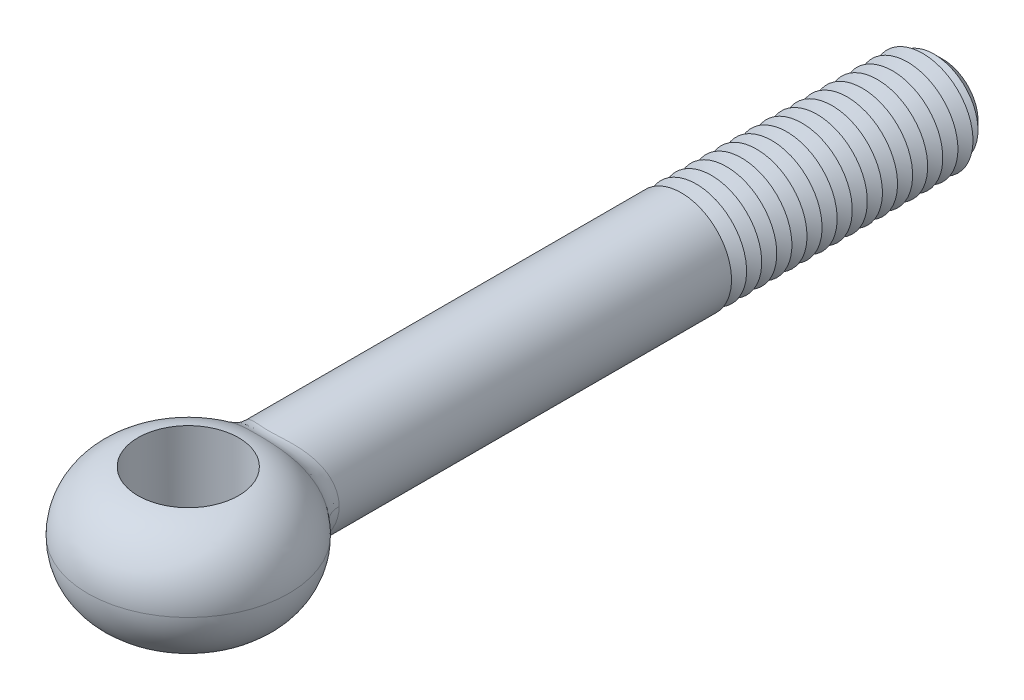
ISO-10303-21;
HEADER;
FILE_DESCRIPTION(('STEP AP214'),'2;1');
FILE_NAME('part.step','',(''),(''),'','','');
FILE_SCHEMA(('AUTOMOTIVE_DESIGN { 1 0 10303 214 1 1 1 1 }'));
ENDSEC;
DATA;
#1=APPLICATION_CONTEXT('core data for automotive mechanical design processes');
#2=APPLICATION_PROTOCOL_DEFINITION('international standard','automotive_design',2000,#1);
#3=PRODUCT_CONTEXT('',#1,'mechanical');
#4=PRODUCT('Part','Part','',(#3));
#5=PRODUCT_RELATED_PRODUCT_CATEGORY('part','',(#4));
#6=PRODUCT_DEFINITION_FORMATION('','',#4);
#7=PRODUCT_DEFINITION_CONTEXT('part definition',#1,'design');
#8=PRODUCT_DEFINITION('design','',#6,#7);
#9=PRODUCT_DEFINITION_SHAPE('','',#8);
#10=(LENGTH_UNIT() NAMED_UNIT(*) SI_UNIT(.MILLI.,.METRE.));
#11=(NAMED_UNIT(*) PLANE_ANGLE_UNIT() SI_UNIT($,.RADIAN.));
#12=(NAMED_UNIT(*) SI_UNIT($,.STERADIAN.) SOLID_ANGLE_UNIT());
#13=UNCERTAINTY_MEASURE_WITH_UNIT(LENGTH_MEASURE(1.E-05),#10,'distance_accuracy_value','');
#14=(GEOMETRIC_REPRESENTATION_CONTEXT(3) GLOBAL_UNCERTAINTY_ASSIGNED_CONTEXT((#13)) GLOBAL_UNIT_ASSIGNED_CONTEXT((#10,
#11,#12)) REPRESENTATION_CONTEXT('',''));
#15=CARTESIAN_POINT('',(0.,0.,0.));
#16=DIRECTION('',(0.,0.,1.));
#17=DIRECTION('',(1.,0.,0.));
#18=AXIS2_PLACEMENT_3D('',#15,#16,#17);
#19=CARTESIAN_POINT('',(0.,0.,-75.));
#20=DIRECTION('',(0.,0.,1.));
#21=DIRECTION('',(1.,0.,0.));
#22=AXIS2_PLACEMENT_3D('',#19,#20,#21);
#23=CYLINDRICAL_SURFACE('',#22,5.);
#24=CARTESIAN_POINT('',(0.,0.,-49.));
#25=DIRECTION('',(0.,0.,-1.));
#26=DIRECTION('',(-1.,0.,0.));
#27=AXIS2_PLACEMENT_3D('',#24,#25,#26);
#28=CIRCLE('',#27,5.);
#29=CARTESIAN_POINT('',(-5.,0.,-49.));
#30=VERTEX_POINT('',#29);
#31=EDGE_CURVE('E79',#30,#30,#28,.T.);
#32=ORIENTED_EDGE('',*,*,#31,.F.);
#33=EDGE_LOOP('',(#32));
#34=FACE_BOUND('',#33,.T.);
#35=CARTESIAN_POINT('',(5.70933633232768,-1.67793970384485,-7.91661551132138));
#36=CARTESIAN_POINT('',(4.78485907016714,-1.45712787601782,-8.66263274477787));
#37=CARTESIAN_POINT('',(4.74222098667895,-1.58472083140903,-9.86340741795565));
#38=CARTESIAN_POINT('',(5.75730171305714,-1.54348560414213,-7.93032827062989));
#39=CARTESIAN_POINT('',(4.82077417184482,-1.33824625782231,-8.67714724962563));
#40=CARTESIAN_POINT('',(4.78467318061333,-1.45773640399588,-9.88591758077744));
#41=CARTESIAN_POINT('',(5.79949566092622,-1.40701265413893,-7.94241329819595));
#42=CARTESIAN_POINT('',(4.85215615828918,-1.2184928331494,-8.68986188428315));
#43=CARTESIAN_POINT('',(4.82205710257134,-1.3288452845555,-9.90573407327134));
#44=CARTESIAN_POINT('',(5.87207824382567,-1.13100094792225,-7.96322651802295));
#45=CARTESIAN_POINT('',(4.90596898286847,-0.977373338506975,-8.71170047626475));
#46=CARTESIAN_POINT('',(4.8864097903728,-1.06816756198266,-9.93983844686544));
#47=CARTESIAN_POINT('',(5.90246657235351,-0.991462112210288,-7.97195462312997));
#48=CARTESIAN_POINT('',(4.92837078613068,-0.856067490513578,-8.72081272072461));
#49=CARTESIAN_POINT('',(4.91337828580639,-0.936380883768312,-9.95412618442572));
#50=CARTESIAN_POINT('',(5.95114734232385,-0.710445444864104,-7.9859445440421));
#51=CARTESIAN_POINT('',(4.96420368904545,-0.612503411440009,-8.73540084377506));
#52=CARTESIAN_POINT('',(4.95659653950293,-0.670976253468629,-9.9770185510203));
#53=CARTESIAN_POINT('',(5.96945246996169,-0.568969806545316,-7.99120999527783));
#54=CARTESIAN_POINT('',(4.97762446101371,-0.4903115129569,-8.7408725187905));
#55=CARTESIAN_POINT('',(4.97285753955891,-0.53736037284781,-9.98562914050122));
#56=CARTESIAN_POINT('',(5.99388312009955,-0.285021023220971,-7.99823914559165));
#57=CARTESIAN_POINT('',(4.99552781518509,-0.245401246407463,-8.74817451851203));
#58=CARTESIAN_POINT('',(4.9945634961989,-0.269186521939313,-9.99712197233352));
#59=CARTESIAN_POINT('',(6.00000915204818,-0.142547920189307,-8.00000299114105));
#60=CARTESIAN_POINT('',(5.00000073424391,-0.122751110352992,-8.75000090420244));
#61=CARTESIAN_POINT('',(5.00000890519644,-0.134628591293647,-10.0000044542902));
#62=CARTESIAN_POINT('',(5.99998170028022,0.285027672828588,-7.9999940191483));
#63=CARTESIAN_POINT('',(4.99999853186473,0.245443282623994,-8.74999819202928));
#64=CARTESIAN_POINT('',(4.99998219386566,0.269192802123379,-9.99999109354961));
#65=CARTESIAN_POINT('',(5.97543439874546,0.570354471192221,-7.99292407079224));
#66=CARTESIAN_POINT('',(4.9821186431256,0.490872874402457,-8.74269384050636));
#67=CARTESIAN_POINT('',(4.97815756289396,0.538668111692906,-9.98843996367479));
#68=CARTESIAN_POINT('',(5.87802487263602,1.13244543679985,-7.96493065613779));
#69=CARTESIAN_POINT('',(4.9104019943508,0.97806395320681,-8.71349780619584));
#70=CARTESIAN_POINT('',(4.89167997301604,1.06953180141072,-9.94263205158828));
#71=CARTESIAN_POINT('',(5.80517393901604,1.40921158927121,-7.94401042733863));
#72=CARTESIAN_POINT('',(4.85673202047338,1.2193014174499,-8.69167389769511));
#73=CARTESIAN_POINT('',(4.82703702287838,1.33092205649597,-9.90838057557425));
#74=CARTESIAN_POINT('',(5.61360560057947,1.94636814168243,-7.88925114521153));
#75=CARTESIAN_POINT('',(4.71337355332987,1.6936723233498,-8.63374813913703));
#76=CARTESIAN_POINT('',(4.65749953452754,1.83823657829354,-9.81848441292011));
#77=CARTESIAN_POINT('',(5.49493943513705,2.20677645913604,-7.85542652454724));
#78=CARTESIAN_POINT('',(4.62401912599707,1.92638432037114,-8.5977797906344));
#79=CARTESIAN_POINT('',(4.55264996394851,2.08417776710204,-9.76286362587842));
#80=CARTESIAN_POINT('',(5.21512465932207,2.70477762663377,-7.77634454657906));
#81=CARTESIAN_POINT('',(4.40944274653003,2.37905924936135,-8.51226210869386));
#82=CARTESIAN_POINT('',(4.30638809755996,2.55451220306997,-9.63232210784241));
#83=CARTESIAN_POINT('',(5.05396822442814,2.94236626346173,-7.73108508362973));
#84=CARTESIAN_POINT('',(4.28460020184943,2.59873536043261,-8.46285983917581));
#85=CARTESIAN_POINT('',(4.16496906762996,2.77890147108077,-9.55739782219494));
#86=CARTESIAN_POINT('',(4.68878033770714,3.39465162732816,-7.63009758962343));
#87=CARTESIAN_POINT('',(3.99636042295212,3.02506283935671,-8.35059743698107));
#88=CARTESIAN_POINT('',(3.84629057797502,3.20605987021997,-9.38937425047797));
#89=CARTESIAN_POINT('',(4.48379609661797,3.6086457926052,-7.5741404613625));
#90=CARTESIAN_POINT('',(3.83251261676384,3.23118784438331,-8.28758835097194));
#91=CARTESIAN_POINT('',(3.66823867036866,3.40816547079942,-9.29587502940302));
#92=CARTESIAN_POINT('',(4.03738444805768,4.00257302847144,-7.45571442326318));
#93=CARTESIAN_POINT('',(3.4692141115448,3.61860897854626,-8.151626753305));
#94=CARTESIAN_POINT('',(3.28354447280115,3.78020786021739,-9.0966982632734));
#95=CARTESIAN_POINT('',(3.79593554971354,4.18248587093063,-7.39324168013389));
#96=CARTESIAN_POINT('',(3.27014962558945,3.79997642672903,-8.07879276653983));
#97=CARTESIAN_POINT('',(3.07688532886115,3.95012554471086,-8.99101354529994));
#98=CARTESIAN_POINT('',(3.40123219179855,4.42911791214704,-7.29642098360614));
#99=CARTESIAN_POINT('',(2.93930728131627,4.05417647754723,-7.96363404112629));
#100=CARTESIAN_POINT('',(2.74263758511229,4.18305580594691,-8.82596610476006));
#101=CARTESIAN_POINT('',(3.25969837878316,4.50936136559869,-7.26261845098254));
#102=CARTESIAN_POINT('',(2.8201432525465,4.13782103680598,-7.92314276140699));
#103=CARTESIAN_POINT('',(2.62340068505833,4.25884128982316,-8.76811514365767));
#104=CARTESIAN_POINT('',(2.96753926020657,4.65896012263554,-7.19555640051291));
#105=CARTESIAN_POINT('',(2.57266117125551,4.2954808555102,-7.84210488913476));
#106=CARTESIAN_POINT('',(2.37882216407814,4.40012900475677,-8.65285466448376));
#107=CARTESIAN_POINT('',(2.81691254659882,4.728313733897,-7.16229696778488));
#108=CARTESIAN_POINT('',(2.44436296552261,4.36954883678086,-7.80155235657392));
#109=CARTESIAN_POINT('',(2.25347959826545,4.46562963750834,-8.59544521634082));
#110=CARTESIAN_POINT('',(2.5068398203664,4.85571433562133,-7.09757737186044));
#111=CARTESIAN_POINT('',(2.1789642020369,4.50703843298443,-7.72199796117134));
#112=CARTESIAN_POINT('',(1.99726881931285,4.58595242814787,-8.48324311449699));
#113=CARTESIAN_POINT('',(2.34739348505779,4.91376091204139,-7.06611727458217));
#114=CARTESIAN_POINT('',(2.04185963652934,4.57052436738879,-7.68297774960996));
#115=CARTESIAN_POINT('',(1.86640040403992,4.64077419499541,-8.42845055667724));
#116=CARTESIAN_POINT('',(2.01991855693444,5.01813022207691,-7.00658441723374));
#117=CARTESIAN_POINT('',(1.7592739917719,4.68575118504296,-7.60861634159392));
#118=CARTESIAN_POINT('',(1.59962901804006,4.73934521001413,-8.32432471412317));
#119=CARTESIAN_POINT('',(1.85189250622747,5.0644564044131,-6.97851066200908));
#120=CARTESIAN_POINT('',(1.61375899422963,4.73756667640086,-7.57324263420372));
#121=CARTESIAN_POINT('',(1.46372754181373,4.78309771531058,-8.27498982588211));
#122=CARTESIAN_POINT('',(1.54958918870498,5.13512197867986,-6.93385736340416));
#123=CARTESIAN_POINT('',(1.35128568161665,4.81724563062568,-7.51664891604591));
#124=CARTESIAN_POINT('',(1.22100149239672,4.84983742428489,-8.19622805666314));
#125=CARTESIAN_POINT('',(1.41702320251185,5.16206874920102,-6.91614202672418));
#126=CARTESIAN_POINT('',(1.23600744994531,4.84788364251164,-7.49407261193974));
#127=CARTESIAN_POINT('',(1.11512872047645,4.87528715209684,-8.16487589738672));
#128=CARTESIAN_POINT('',(1.1478154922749,5.20870116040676,-6.88469379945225));
#129=CARTESIAN_POINT('',(1.00167278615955,4.9011561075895,-7.4538678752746));
#130=CARTESIAN_POINT('',(0.901179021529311,4.91932887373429,-8.10909028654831));
#131=CARTESIAN_POINT('',(1.01117500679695,5.22838898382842,-6.87095971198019));
#132=CARTESIAN_POINT('',(0.882566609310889,4.92382141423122,-7.43621856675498));
#133=CARTESIAN_POINT('',(0.793102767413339,4.93792292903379,-8.08465475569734));
#134=CARTESIAN_POINT('',(0.735138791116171,5.26020100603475,-6.84839392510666));
#135=CARTESIAN_POINT('',(0.641846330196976,4.96055155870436,-7.40716717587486));
#136=CARTESIAN_POINT('',(0.575594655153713,4.96796761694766,-8.04444298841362));
#137=CARTESIAN_POINT('',(0.595753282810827,5.27234921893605,-6.83954667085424));
#138=CARTESIAN_POINT('',(0.520175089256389,4.97466593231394,-7.39572843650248));
#139=CARTESIAN_POINT('',(0.46616824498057,4.97944092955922,-8.02863927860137));
#140=CARTESIAN_POINT('',(0.315165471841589,5.28897400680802,-6.82736189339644));
#141=CARTESIAN_POINT('',(0.275245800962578,4.99399490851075,-7.37997063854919));
#142=CARTESIAN_POINT('',(0.246357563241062,4.99514211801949,-8.00686062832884));
#143=CARTESIAN_POINT('',(0.173963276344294,5.2934510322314,-6.82402404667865));
#144=CARTESIAN_POINT('',(0.151908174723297,4.99922289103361,-7.37564077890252));
#145=CARTESIAN_POINT('',(0.135973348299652,4.99937041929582,-8.0008851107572));
#146=CARTESIAN_POINT('',(-0.108989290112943,5.29464772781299,-6.82313610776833));
#147=CARTESIAN_POINT('',(-0.0951661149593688,5.00061790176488,-7.37449052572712));
#148=CARTESIAN_POINT('',(-0.0851888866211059,5.00050063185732,-7.99929621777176));
#149=CARTESIAN_POINT('',(-0.250740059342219,5.29134475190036,-6.82560291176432));
#150=CARTESIAN_POINT('',(-0.218988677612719,4.99675944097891,-7.37769125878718));
#151=CARTESIAN_POINT('',(-0.195967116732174,4.99738115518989,-8.00371309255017));
#152=CARTESIAN_POINT('',(-0.532654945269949,5.27700059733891,-6.83615005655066));
#153=CARTESIAN_POINT('',(-0.465097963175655,4.98007057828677,-7.39133726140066));
#154=CARTESIAN_POINT('',(-0.416687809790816,4.98383389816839,-8.02257034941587));
#155=CARTESIAN_POINT('',(-0.67281897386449,5.26595899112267,-6.84423070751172));
#156=CARTESIAN_POINT('',(-0.587466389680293,4.96722840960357,-7.40179208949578));
#157=CARTESIAN_POINT('',(-0.526630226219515,4.97340571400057,-8.03701128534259));
#158=CARTESIAN_POINT('',(-0.950555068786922,5.23628582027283,-6.86540697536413));
#159=CARTESIAN_POINT('',(-0.829715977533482,4.93292383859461,-7.42907738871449));
#160=CARTESIAN_POINT('',(-0.745246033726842,4.94538105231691,-8.07476785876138));
#161=CARTESIAN_POINT('',(-1.08811773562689,5.21763079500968,-6.87851808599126));
#162=CARTESIAN_POINT('',(-0.949657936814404,4.91141341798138,-7.44594394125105));
#163=CARTESIAN_POINT('',(-0.853914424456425,4.92776241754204,-8.09811091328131));
#164=CARTESIAN_POINT('',(-1.35925236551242,5.17298457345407,-6.90887821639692));
#165=CARTESIAN_POINT('',(-1.18574740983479,4.86032128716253,-7.48480231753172));
#166=CARTESIAN_POINT('',(-1.06910038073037,4.88559654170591,-8.15200622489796));
#167=CARTESIAN_POINT('',(-1.49282310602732,5.14699115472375,-6.92612848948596));
#168=CARTESIAN_POINT('',(-1.3019475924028,4.83070907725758,-7.50681516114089));
#169=CARTESIAN_POINT('',(-1.17561728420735,4.86104720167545,-8.18256066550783));
#170=CARTESIAN_POINT('',(-1.79412725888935,5.07920893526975,-6.96939072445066));
#171=CARTESIAN_POINT('',(-1.56367143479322,4.75412691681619,-7.56172008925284));
#172=CARTESIAN_POINT('',(-1.41717349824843,4.79703066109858,-8.25893420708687));
#173=CARTESIAN_POINT('',(-1.96031219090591,5.03502254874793,-6.9964861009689));
#174=CARTESIAN_POINT('',(-1.7076868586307,4.70458666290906,-7.59591788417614));
#175=CARTESIAN_POINT('',(-1.55135538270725,4.75529907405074,-8.30659722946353));
#176=CARTESIAN_POINT('',(-2.28442640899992,4.93526422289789,-7.05416576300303));
#177=CARTESIAN_POINT('',(-1.98760872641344,4.59415189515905,-7.66809997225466));
#178=CARTESIAN_POINT('',(-1.81491123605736,4.66108287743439,-8.4075911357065));
#179=CARTESIAN_POINT('',(-2.44235350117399,4.87968927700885,-7.08475096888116));
#180=CARTESIAN_POINT('',(-2.12355225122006,4.53318622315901,-7.7061166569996));
#181=CARTESIAN_POINT('',(-1.94428392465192,4.6085954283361,-8.46092351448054));
#182=CARTESIAN_POINT('',(-2.74972999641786,4.75754570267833,-7.14786353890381));
#183=CARTESIAN_POINT('',(-2.38698376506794,4.4009346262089,-7.78387796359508));
#184=CARTESIAN_POINT('',(-2.19777297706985,4.49323760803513,-8.57047607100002));
#185=CARTESIAN_POINT('',(-2.89917785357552,4.69097507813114,-7.18039125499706));
#186=CARTESIAN_POINT('',(-2.51447749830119,4.3295842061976,-7.82364214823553));
#187=CARTESIAN_POINT('',(-2.32188838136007,4.43036535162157,-8.62669677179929));
#188=CARTESIAN_POINT('',(-3.18935059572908,4.54721522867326,-7.24614756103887));
#189=CARTESIAN_POINT('',(-2.76071126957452,4.17750789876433,-7.90331839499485));
#190=CARTESIAN_POINT('',(-2.56432860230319,4.29459216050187,-8.73986385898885));
#191=CARTESIAN_POINT('',(-3.33007632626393,4.470027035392,-7.27937608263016));
#192=CARTESIAN_POINT('',(-2.87943530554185,4.09672952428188,-7.94323785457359));
#193=CARTESIAN_POINT('',(-2.68265398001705,4.22169220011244,-8.79681017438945));
#194=CARTESIAN_POINT('',(-3.6042467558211,4.30435953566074,-7.34597396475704));
#195=CARTESIAN_POINT('',(-3.10933500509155,3.92558371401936,-8.02254739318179));
#196=CARTESIAN_POINT('',(-2.91439424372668,4.06522845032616,-8.91049638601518));
#197=CARTESIAN_POINT('',(-3.73757981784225,4.21575233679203,-7.37933998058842));
#198=CARTESIAN_POINT('',(-3.2203567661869,3.83507165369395,-8.06191973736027));
#199=CARTESIAN_POINT('',(-3.02773025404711,3.98154387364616,-8.96722500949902));
#200=CARTESIAN_POINT('',(-3.99465713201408,4.02844559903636,-7.44499615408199));
#201=CARTESIAN_POINT('',(-3.4329684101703,3.6461579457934,-8.13872764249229));
#202=CARTESIAN_POINT('',(-3.24724328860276,3.80464306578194,-9.07845523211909));
#203=CARTESIAN_POINT('',(-4.11839810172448,3.92974263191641,-7.47728594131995));
#204=CARTESIAN_POINT('',(-3.53450475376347,3.54772458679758,-8.17615102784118));
#205=CARTESIAN_POINT('',(-3.35341786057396,3.7114235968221,-9.13295606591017));
#206=CARTESIAN_POINT('',(-4.4742983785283,3.61934152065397,-7.57148302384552));
#207=CARTESIAN_POINT('',(-3.82504690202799,3.24133753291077,-8.28463882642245));
#208=CARTESIAN_POINT('',(-3.65994988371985,3.41826699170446,-9.29144497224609));
#209=CARTESIAN_POINT('',(-4.69150601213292,3.39312616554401,-7.63081129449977));
#210=CARTESIAN_POINT('',(-3.99866350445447,3.02332690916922,-8.35144779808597));
#211=CARTESIAN_POINT('',(-3.84863084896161,3.20461915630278,-9.39057819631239));
#212=CARTESIAN_POINT('',(-5.08239605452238,2.90516999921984,-7.7389888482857));
#213=CARTESIAN_POINT('',(-4.30703736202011,2.56373758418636,-8.47164826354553));
#214=CARTESIAN_POINT('',(-4.18981749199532,2.7437716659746,-9.57053028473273));
#215=CARTESIAN_POINT('',(-5.25565953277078,2.6431214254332,-7.78773667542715));
#216=CARTESIAN_POINT('',(-4.44086470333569,2.32212555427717,-8.52470741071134));
#217=CARTESIAN_POINT('',(-4.34197429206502,2.49628134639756,-9.6511722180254));
#218=CARTESIAN_POINT('',(-5.47691244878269,2.23061013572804,-7.85038077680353));
#219=CARTESIAN_POINT('',(-4.60972026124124,1.94915142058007,-8.5921412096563));
#220=CARTESIAN_POINT('',(-4.53685371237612,2.10668735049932,-9.75449897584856));
#221=CARTESIAN_POINT('',(-5.54423274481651,2.08983618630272,-7.86951868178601));
#222=CARTESIAN_POINT('',(-4.66073830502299,1.82281743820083,-8.61261317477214));
#223=CARTESIAN_POINT('',(-4.59626286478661,1.97373417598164,-9.78600646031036));
#224=CARTESIAN_POINT('',(-5.6655118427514,1.80280855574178,-7.90408060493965));
#225=CARTESIAN_POINT('',(-4.75217227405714,1.56712957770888,-8.64941478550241));
#226=CARTESIAN_POINT('',(-4.70342427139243,1.70265252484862,-9.84283573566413));
#227=CARTESIAN_POINT('',(-5.71947280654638,1.65655576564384,-7.91950522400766));
#228=CARTESIAN_POINT('',(-4.79253620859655,1.43783844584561,-8.66572382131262));
#229=CARTESIAN_POINT('',(-4.75117841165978,1.56452488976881,-9.86815852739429));
#230=CARTESIAN_POINT('',(-5.84364491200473,1.26465047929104,-7.95505164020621));
#231=CARTESIAN_POINT('',(-4.88513469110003,1.09319520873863,-8.7032138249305));
#232=CARTESIAN_POINT('',(-4.86116183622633,1.19439211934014,-9.92646411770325));
#233=CARTESIAN_POINT('',(-5.90216979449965,1.0152606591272,-7.97186627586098));
#234=CARTESIAN_POINT('',(-4.9281911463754,0.87634254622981,-8.72073502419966));
#235=CARTESIAN_POINT('',(-4.91310928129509,0.958857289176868,-9.95398462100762));
#236=CARTESIAN_POINT('',(-5.98033817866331,0.510520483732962,-7.99433762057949));
#237=CARTESIAN_POINT('',(-4.98567189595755,0.439420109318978,-8.74414731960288));
#238=CARTESIAN_POINT('',(-4.98251976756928,0.482158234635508,-9.99074818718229));
#239=CARTESIAN_POINT('',(-5.99999017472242,0.255171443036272,-7.99999676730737));
#240=CARTESIAN_POINT('',(-5.00000016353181,0.219732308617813,-8.74999935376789));
#241=CARTESIAN_POINT('',(-4.99999034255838,0.240995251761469,-9.99999524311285));
#242=CARTESIAN_POINT('',(-6.00000548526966,-0.142457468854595,-8.00000180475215));
#243=CARTESIAN_POINT('',(-4.99999990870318,-0.12267252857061,-8.75000036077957));
#244=CARTESIAN_POINT('',(-5.00000539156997,-0.134543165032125,-10.0000026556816));
#245=CARTESIAN_POINT('',(-5.99388893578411,-0.284859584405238,-7.99824078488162));
#246=CARTESIAN_POINT('',(-4.99553255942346,-0.245262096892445,-8.74817640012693));
#247=CARTESIAN_POINT('',(-4.9945685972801,-0.269034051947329,-9.99712468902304));
#248=CARTESIAN_POINT('',(-5.96948629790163,-0.568670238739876,-7.99121976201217));
#249=CARTESIAN_POINT('',(-4.97764876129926,-0.490053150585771,-8.74088248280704));
#250=CARTESIAN_POINT('',(-4.97288766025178,-0.537077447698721,-9.98564507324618));
#251=CARTESIAN_POINT('',(-5.95119862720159,-0.71007864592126,-7.98595930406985));
#252=CARTESIAN_POINT('',(-4.96424116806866,-0.612186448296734,-8.73541613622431));
#253=CARTESIAN_POINT('',(-4.9566421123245,-0.670629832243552,-9.97704267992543));
#254=CARTESIAN_POINT('',(-5.90253985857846,-0.991109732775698,-7.9719756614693));
#255=CARTESIAN_POINT('',(-4.92842498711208,-0.855761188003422,-8.72083475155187));
#256=CARTESIAN_POINT('',(-4.9134433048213,-0.936048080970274,-9.95416063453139));
#257=CARTESIAN_POINT('',(-5.87214378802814,-1.13072810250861,-7.96324532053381));
#258=CARTESIAN_POINT('',(-4.90601756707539,-0.977135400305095,-8.71172020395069));
#259=CARTESIAN_POINT('',(-4.88646791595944,-1.06790987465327,-9.93986924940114));
#260=CARTESIAN_POINT('',(-5.79953551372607,-1.40688471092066,-7.94242472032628));
#261=CARTESIAN_POINT('',(-4.85218573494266,-1.21838046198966,-8.68987387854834));
#262=CARTESIAN_POINT('',(-4.82209242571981,-1.32872444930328,-9.90575279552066));
#263=CARTESIAN_POINT('',(-5.75732457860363,-1.54342327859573,-7.9303348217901));
#264=CARTESIAN_POINT('',(-4.82079113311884,-1.33819110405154,-8.67715412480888));
#265=CARTESIAN_POINT('',(-4.78469344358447,-1.45767754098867,-9.8859283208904));
#266=CARTESIAN_POINT('',(-5.70933633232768,-1.67793970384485,-7.91661551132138));
#267=CARTESIAN_POINT('',(-4.78485907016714,-1.45712787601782,-8.66263274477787));
#268=CARTESIAN_POINT('',(-4.74222098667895,-1.58472083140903,-9.86340741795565));
#269=(BOUNDED_SURFACE() B_SPLINE_SURFACE(3,2,((#35,#36,#37),(#38,#39,#40),(#41,#42,#43),(#44,
#45,#46),(#47,#48,#49),(#50,#51,#52),(#53,#54,#55),(#56,#57,#58),(#59,#60,#61),(#62,#63,#64),
(#65,#66,#67),(#68,#69,#70),(#71,#72,#73),(#74,#75,#76),(#77,#78,#79),(#80,#81,#82),(#83,#84,
#85),(#86,#87,#88),(#89,#90,#91),(#92,#93,#94),(#95,#96,#97),(#98,#99,#100),(#101,#102,#103),
(#104,#105,#106),(#107,#108,#109),(#110,#111,#112),(#113,#114,#115),(#116,#117,#118),(#119,#120,
#121),(#122,#123,#124),(#125,#126,#127),(#128,#129,#130),(#131,#132,#133),(#134,#135,#136),
(#137,#138,#139),(#140,#141,#142),(#143,#144,#145),(#146,#147,#148),(#149,#150,#151),(#152,#153,
#154),(#155,#156,#157),(#158,#159,#160),(#161,#162,#163),(#164,#165,#166),(#167,#168,#169),
(#170,#171,#172),(#173,#174,#175),(#176,#177,#178),(#179,#180,#181),(#182,#183,#184),(#185,#186,
#187),(#188,#189,#190),(#191,#192,#193),(#194,#195,#196),(#197,#198,#199),(#200,#201,#202),
(#203,#204,#205),(#206,#207,#208),(#209,#210,#211),(#212,#213,#214),(#215,#216,#217),(#218,#219,
#220),(#221,#222,#223),(#224,#225,#226),(#227,#228,#229),(#230,#231,#232),(#233,#234,#235),
(#236,#237,#238),(#239,#240,#241),(#242,#243,#244),(#245,#246,#247),(#248,#249,#250),(#251,#252,
#253),(#254,#255,#256),(#257,#258,#259),(#260,#261,#262),(#263,#264,#265),(#266,#267,#268)),
.UNSPECIFIED.,.F.,.F.,.F.) B_SPLINE_SURFACE_WITH_KNOTS((4,2,2,2,2,2,2,2,2,2,2,2,2,2,2,2,2,2,2,2,
2,2,2,2,2,2,2,2,2,2,2,2,2,2,2,2,2,2,4),(3,3),(0.,0.606107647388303,1.21223102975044,
1.81771702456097,2.42317769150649,3.63380948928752,4.8441584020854,6.05315757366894,
7.26237953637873,8.50119582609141,9.74074509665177,10.3991744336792,11.0577059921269,
11.7162616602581,12.3746233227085,12.8731342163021,13.3714950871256,13.8682603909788,
14.3649965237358,14.8631803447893,15.3613916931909,15.8611500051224,16.3610598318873,
17.0084707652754,17.6560528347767,18.3037525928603,18.9513894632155,19.607039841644,
20.2629136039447,21.5729073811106,22.8949562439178,23.5562483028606,24.2174332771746,
25.3015758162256,26.385481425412,26.9906057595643,27.5958087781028,28.2022664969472,
28.8086591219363),(0.,1.),
.UNSPECIFIED.) GEOMETRIC_REPRESENTATION_ITEM() RATIONAL_B_SPLINE_SURFACE(((1.,0.90035547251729,
1.),(1.,0.899388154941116,1.),(1.,0.898532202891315,1.),(1.,0.897054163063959,1.),(1.,
0.896432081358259,1.),(1.,0.895433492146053,1.),(1.,0.895056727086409,1.),(1.,0.894553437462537,
1.),(1.,0.894426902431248,1.),(1.,0.894427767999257,1.),(1.,0.89493539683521,1.),(1.,
0.896933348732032,1.),(1.,0.898423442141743,1.),(1.,0.902285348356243,1.),(1.,0.904656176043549,
1.),(1.,0.910127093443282,1.),(1.,0.913227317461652,1.),(1.,0.9200380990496,1.),(1.,
0.923761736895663,1.),(1.,0.931504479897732,1.),(1.,0.935523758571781,1.),(1.,0.941644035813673,
1.),(1.,0.943760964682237,1.),(1.,0.947923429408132,1.),(1.,0.949968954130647,1.),(1.,
0.953916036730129,1.),(1.,0.955817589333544,1.),(1.,0.959389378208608,1.),(1.,0.96105968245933,
1.),(1.,0.963700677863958,1.),(1.,0.964742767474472,1.),(1.,0.966586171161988,1.),(1.,
0.967387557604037,1.),(1.,0.968701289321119,1.),(1.,0.969214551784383,1.),(1.,0.96992083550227,
1.),(1.,0.970113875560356,1.),(1.,0.97016526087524,1.),(1.,0.970022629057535,1.),(1.,
0.96941153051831,1.),(1.,0.968943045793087,1.),(1.,0.967711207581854,1.),(1.,0.966946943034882,
1.),(1.,0.965169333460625,1.),(1.,0.964155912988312,1.),(1.,0.961600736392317,1.),(1.,
0.959991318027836,1.),(1.,0.956537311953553,1.),(1.,0.954692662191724,1.),(1.,0.950852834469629,
1.),(1.,0.948857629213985,1.),(1.,0.944787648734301,1.),(1.,0.942712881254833,1.),(1.,
0.938516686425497,1.),(1.,0.936394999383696,1.),(1.,0.932182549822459,1.),(1.,0.930091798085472,
1.),(1.,0.923939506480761,1.),(1.,0.91999203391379,1.),(1.,0.912692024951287,1.),(1.,
0.909345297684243,1.),(1.,0.905000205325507,1.),(1.,0.903664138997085,1.),(1.,0.901240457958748,
1.),(1.,0.900152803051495,1.),(1.,0.897638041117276,1.),(1.,0.896438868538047,1.),(1.,
0.894833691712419,1.),(1.,0.894427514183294,1.),(1.,0.894427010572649,1.),(1.,0.894553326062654,
1.),(1.,0.895056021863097,1.),(1.,0.895432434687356,1.),(1.,0.896430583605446,1.),(1.,
0.897052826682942,1.),(1.,0.898531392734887,1.),(1.,0.89938769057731,1.),(1.,0.90035547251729,1.))) REPRESENTATION_ITEM('') SURFACE());
#270=CARTESIAN_POINT('',(-4.74222098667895,-1.58472083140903,-9.86340741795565));
#271=CARTESIAN_POINT('',(-4.78469344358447,-1.45767754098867,-9.8859283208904));
#272=CARTESIAN_POINT('',(-4.82209242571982,-1.32872444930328,-9.90575279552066));
#273=CARTESIAN_POINT('',(-4.88646791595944,-1.06790987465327,-9.93986924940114));
#274=CARTESIAN_POINT('',(-4.9134433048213,-0.936048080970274,-9.95416063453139));
#275=CARTESIAN_POINT('',(-4.9566421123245,-0.670629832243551,-9.97704267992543));
#276=CARTESIAN_POINT('',(-4.97288766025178,-0.537077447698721,-9.98564507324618));
#277=CARTESIAN_POINT('',(-4.9945685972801,-0.269034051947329,-9.99712468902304));
#278=CARTESIAN_POINT('',(-5.00000539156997,-0.134543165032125,-10.0000026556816));
#279=CARTESIAN_POINT('',(-4.99999034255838,0.240995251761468,-9.99999524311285));
#280=CARTESIAN_POINT('',(-4.98251976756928,0.482158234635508,-9.99074818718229));
#281=CARTESIAN_POINT('',(-4.91310928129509,0.958857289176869,-9.95398462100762));
#282=CARTESIAN_POINT('',(-4.86116183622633,1.19439211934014,-9.92646411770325));
#283=CARTESIAN_POINT('',(-4.75117841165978,1.56452488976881,-9.86815852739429));
#284=CARTESIAN_POINT('',(-4.70342427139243,1.70265252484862,-9.84283573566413));
#285=CARTESIAN_POINT('',(-4.59626286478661,1.97373417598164,-9.78600646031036));
#286=CARTESIAN_POINT('',(-4.53685371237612,2.10668735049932,-9.75449897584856));
#287=CARTESIAN_POINT('',(-4.34197429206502,2.49628134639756,-9.6511722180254));
#288=CARTESIAN_POINT('',(-4.18981749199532,2.7437716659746,-9.57053028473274));
#289=CARTESIAN_POINT('',(-3.84863084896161,3.20461915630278,-9.39057819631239));
#290=CARTESIAN_POINT('',(-3.65994988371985,3.41826699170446,-9.29144497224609));
#291=CARTESIAN_POINT('',(-3.35341786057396,3.7114235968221,-9.13295606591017));
#292=CARTESIAN_POINT('',(-3.24724328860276,3.80464306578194,-9.07845523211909));
#293=CARTESIAN_POINT('',(-3.02773025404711,3.98154387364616,-8.96722500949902));
#294=CARTESIAN_POINT('',(-2.91439424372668,4.06522845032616,-8.91049638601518));
#295=CARTESIAN_POINT('',(-2.68265398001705,4.22169220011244,-8.79681017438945));
#296=CARTESIAN_POINT('',(-2.56432860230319,4.29459216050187,-8.73986385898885));
#297=CARTESIAN_POINT('',(-2.32188838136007,4.43036535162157,-8.62669677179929));
#298=CARTESIAN_POINT('',(-2.19777297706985,4.49323760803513,-8.57047607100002));
#299=CARTESIAN_POINT('',(-1.94428392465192,4.6085954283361,-8.46092351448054));
#300=CARTESIAN_POINT('',(-1.81491123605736,4.66108287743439,-8.4075911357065));
#301=CARTESIAN_POINT('',(-1.55135538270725,4.75529907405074,-8.30659722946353));
#302=CARTESIAN_POINT('',(-1.41717349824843,4.79703066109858,-8.25893420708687));
#303=CARTESIAN_POINT('',(-1.17561728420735,4.86104720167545,-8.18256066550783));
#304=CARTESIAN_POINT('',(-1.06910038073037,4.88559654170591,-8.15200622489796));
#305=CARTESIAN_POINT('',(-0.853914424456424,4.92776241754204,-8.09811091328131));
#306=CARTESIAN_POINT('',(-0.745246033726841,4.94538105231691,-8.07476785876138));
#307=CARTESIAN_POINT('',(-0.526630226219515,4.97340571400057,-8.03701128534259));
#308=CARTESIAN_POINT('',(-0.416687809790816,4.98383389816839,-8.02257034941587));
#309=CARTESIAN_POINT('',(-0.195967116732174,4.99738115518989,-8.00371309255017));
#310=CARTESIAN_POINT('',(-0.0851888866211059,5.00050063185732,-7.99929621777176));
#311=CARTESIAN_POINT('',(0.135973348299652,4.99937041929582,-8.0008851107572));
#312=CARTESIAN_POINT('',(0.246357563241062,4.99514211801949,-8.00686062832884));
#313=CARTESIAN_POINT('',(0.46616824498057,4.97944092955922,-8.02863927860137));
#314=CARTESIAN_POINT('',(0.575594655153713,4.96796761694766,-8.04444298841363));
#315=CARTESIAN_POINT('',(0.793102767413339,4.93792292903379,-8.08465475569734));
#316=CARTESIAN_POINT('',(0.901179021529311,4.91932887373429,-8.10909028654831));
#317=CARTESIAN_POINT('',(1.11512872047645,4.87528715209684,-8.16487589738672));
#318=CARTESIAN_POINT('',(1.22100149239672,4.84983742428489,-8.19622805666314));
#319=CARTESIAN_POINT('',(1.46372754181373,4.78309771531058,-8.27498982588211));
#320=CARTESIAN_POINT('',(1.59962901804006,4.73934521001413,-8.32432471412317));
#321=CARTESIAN_POINT('',(1.86640040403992,4.64077419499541,-8.42845055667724));
#322=CARTESIAN_POINT('',(1.99726881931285,4.58595242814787,-8.48324311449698));
#323=CARTESIAN_POINT('',(2.25347959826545,4.46562963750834,-8.59544521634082));
#324=CARTESIAN_POINT('',(2.37882216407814,4.40012900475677,-8.65285466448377));
#325=CARTESIAN_POINT('',(2.62340068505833,4.25884128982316,-8.76811514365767));
#326=CARTESIAN_POINT('',(2.74263758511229,4.18305580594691,-8.82596610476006));
#327=CARTESIAN_POINT('',(3.07688532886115,3.95012554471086,-8.99101354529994));
#328=CARTESIAN_POINT('',(3.28354447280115,3.78020786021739,-9.0966982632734));
#329=CARTESIAN_POINT('',(3.66823867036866,3.40816547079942,-9.29587502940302));
#330=CARTESIAN_POINT('',(3.84629057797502,3.20605987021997,-9.38937425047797));
#331=CARTESIAN_POINT('',(4.16496906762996,2.77890147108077,-9.55739782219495));
#332=CARTESIAN_POINT('',(4.30638809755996,2.55451220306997,-9.63232210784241));
#333=CARTESIAN_POINT('',(4.55264996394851,2.08417776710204,-9.76286362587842));
#334=CARTESIAN_POINT('',(4.65749953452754,1.83823657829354,-9.81848441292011));
#335=CARTESIAN_POINT('',(4.82703702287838,1.33092205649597,-9.90838057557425));
#336=CARTESIAN_POINT('',(4.89167997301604,1.06953180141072,-9.94263205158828));
#337=CARTESIAN_POINT('',(4.97815756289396,0.538668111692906,-9.98843996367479));
#338=CARTESIAN_POINT('',(4.99998219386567,0.269192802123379,-9.99999109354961));
#339=CARTESIAN_POINT('',(5.00000890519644,-0.134628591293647,-10.0000044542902));
#340=CARTESIAN_POINT('',(4.99456349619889,-0.269186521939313,-9.99712197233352));
#341=CARTESIAN_POINT('',(4.97285753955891,-0.53736037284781,-9.98562914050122));
#342=CARTESIAN_POINT('',(4.95659653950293,-0.670976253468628,-9.9770185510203));
#343=CARTESIAN_POINT('',(4.91337828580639,-0.936380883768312,-9.95412618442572));
#344=CARTESIAN_POINT('',(4.8864097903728,-1.06816756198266,-9.93983844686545));
#345=CARTESIAN_POINT('',(4.82205710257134,-1.3288452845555,-9.90573407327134));
#346=CARTESIAN_POINT('',(4.78467318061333,-1.45773640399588,-9.88591758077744));
#347=CARTESIAN_POINT('',(4.74222098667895,-1.58472083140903,-9.86340741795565));
#348=B_SPLINE_CURVE_WITH_KNOTS('',3,(#270,#271,#272,#273,#274,#275,#276,#277,#278,#279,#280,
#281,#282,#283,#284,#285,#286,#287,#288,#289,#290,#291,#292,#293,#294,#295,#296,#297,#298,#299,
#300,#301,#302,#303,#304,#305,#306,#307,#308,#309,#310,#311,#312,#313,#314,#315,#316,#317,#318,
#319,#320,#321,#322,#323,#324,#325,#326,#327,#328,#329,#330,#331,#332,#333,#334,#335,#336,#337,
#338,#339,#340,#341,#342,#343,#344,#345,#346,#347),.UNSPECIFIED.,.F.,.F.,(4,2,2,2,2,2,2,2,2,2,2,
2,2,2,2,2,2,2,2,2,2,2,2,2,2,2,2,2,2,2,2,2,2,2,2,2,2,2,4),(0.,0.606392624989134,1.21285034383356,
1.81805336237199,2.42317769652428,3.50708330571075,4.59122584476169,5.25241081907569,
5.91370287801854,7.2357517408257,8.54574551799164,9.20161928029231,9.85726965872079,
10.504906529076,11.1526062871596,11.800188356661,12.447599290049,12.9475091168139,
13.4472674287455,13.945478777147,14.4436625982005,14.9403987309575,15.4371640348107,
15.9355249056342,16.4340357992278,17.0923974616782,17.7509531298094,18.4094846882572,
19.0679140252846,20.3074632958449,21.5462795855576,22.7555015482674,23.9645007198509,
25.1748496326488,26.3854814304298,26.9909420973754,27.5964280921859,28.202551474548,
28.8086591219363),.UNSPECIFIED.);
#349=CARTESIAN_POINT('',(-5.,0.,-10.));
#350=VERTEX_POINT('',#349);
#351=CARTESIAN_POINT('',(5.,0.,-10.));
#352=VERTEX_POINT('',#351);
#353=EDGE_CURVE('E81',#350,#352,#348,.T.);
#354=ORIENTED_EDGE('',*,*,#353,.T.);
#355=CARTESIAN_POINT('',(-5.70933633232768,1.67793970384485,-7.91661551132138));
#356=CARTESIAN_POINT('',(-4.78485907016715,1.45712787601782,-8.66263274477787));
#357=CARTESIAN_POINT('',(-4.74222098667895,1.58472083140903,-9.86340741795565));
#358=CARTESIAN_POINT('',(-5.75730171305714,1.54348560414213,-7.93032827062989));
#359=CARTESIAN_POINT('',(-4.82077417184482,1.33824625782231,-8.67714724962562));
#360=CARTESIAN_POINT('',(-4.78467318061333,1.45773640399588,-9.88591758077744));
#361=CARTESIAN_POINT('',(-5.79949566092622,1.40701265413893,-7.94241329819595));
#362=CARTESIAN_POINT('',(-4.85215615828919,1.2184928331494,-8.68986188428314));
#363=CARTESIAN_POINT('',(-4.82205710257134,1.3288452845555,-9.90573407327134));
#364=CARTESIAN_POINT('',(-5.87207824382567,1.13100094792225,-7.96322651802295));
#365=CARTESIAN_POINT('',(-4.90596898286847,0.977373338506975,-8.71170047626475));
#366=CARTESIAN_POINT('',(-4.8864097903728,1.06816756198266,-9.93983844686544));
#367=CARTESIAN_POINT('',(-5.90246657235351,0.991462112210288,-7.97195462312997));
#368=CARTESIAN_POINT('',(-4.92837078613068,0.856067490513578,-8.72081272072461));
#369=CARTESIAN_POINT('',(-4.91337828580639,0.936380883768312,-9.95412618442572));
#370=CARTESIAN_POINT('',(-5.95114734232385,0.710445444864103,-7.9859445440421));
#371=CARTESIAN_POINT('',(-4.96420368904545,0.612503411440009,-8.73540084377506));
#372=CARTESIAN_POINT('',(-4.95659653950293,0.670976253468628,-9.9770185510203));
#373=CARTESIAN_POINT('',(-5.96945246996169,0.568969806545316,-7.99120999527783));
#374=CARTESIAN_POINT('',(-4.97762446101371,0.4903115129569,-8.7408725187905));
#375=CARTESIAN_POINT('',(-4.97285753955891,0.53736037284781,-9.98562914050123));
#376=CARTESIAN_POINT('',(-5.99388312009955,0.28502102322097,-7.99823914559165));
#377=CARTESIAN_POINT('',(-4.99552781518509,0.245401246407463,-8.74817451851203));
#378=CARTESIAN_POINT('',(-4.9945634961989,0.269186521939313,-9.99712197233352));
#379=CARTESIAN_POINT('',(-6.00000915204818,0.142547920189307,-8.00000299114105));
#380=CARTESIAN_POINT('',(-5.00000073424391,0.122751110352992,-8.75000090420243));
#381=CARTESIAN_POINT('',(-5.00000890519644,0.134628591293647,-10.0000044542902));
#382=CARTESIAN_POINT('',(-5.99998170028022,-0.285027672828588,-7.9999940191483));
#383=CARTESIAN_POINT('',(-4.99999853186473,-0.245443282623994,-8.74999819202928));
#384=CARTESIAN_POINT('',(-4.99998219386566,-0.269192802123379,-9.99999109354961));
#385=CARTESIAN_POINT('',(-5.97543439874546,-0.570354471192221,-7.99292407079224));
#386=CARTESIAN_POINT('',(-4.9821186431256,-0.490872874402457,-8.74269384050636));
#387=CARTESIAN_POINT('',(-4.97815756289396,-0.538668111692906,-9.98843996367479));
#388=CARTESIAN_POINT('',(-5.87802487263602,-1.13244543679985,-7.96493065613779));
#389=CARTESIAN_POINT('',(-4.9104019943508,-0.97806395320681,-8.71349780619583));
#390=CARTESIAN_POINT('',(-4.89167997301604,-1.06953180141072,-9.94263205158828));
#391=CARTESIAN_POINT('',(-5.80517393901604,-1.40921158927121,-7.94401042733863));
#392=CARTESIAN_POINT('',(-4.85673202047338,-1.2193014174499,-8.69167389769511));
#393=CARTESIAN_POINT('',(-4.82703702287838,-1.33092205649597,-9.90838057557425));
#394=CARTESIAN_POINT('',(-5.61360560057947,-1.94636814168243,-7.88925114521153));
#395=CARTESIAN_POINT('',(-4.71337355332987,-1.6936723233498,-8.63374813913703));
#396=CARTESIAN_POINT('',(-4.65749953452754,-1.83823657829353,-9.81848441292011));
#397=CARTESIAN_POINT('',(-5.49493943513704,-2.20677645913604,-7.85542652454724));
#398=CARTESIAN_POINT('',(-4.62401912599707,-1.92638432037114,-8.5977797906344));
#399=CARTESIAN_POINT('',(-4.55264996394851,-2.08417776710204,-9.76286362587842));
#400=CARTESIAN_POINT('',(-5.21512465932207,-2.70477762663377,-7.77634454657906));
#401=CARTESIAN_POINT('',(-4.40944274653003,-2.37905924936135,-8.51226210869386));
#402=CARTESIAN_POINT('',(-4.30638809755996,-2.55451220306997,-9.63232210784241));
#403=CARTESIAN_POINT('',(-5.05396822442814,-2.94236626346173,-7.73108508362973));
#404=CARTESIAN_POINT('',(-4.28460020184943,-2.59873536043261,-8.46285983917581));
#405=CARTESIAN_POINT('',(-4.16496906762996,-2.77890147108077,-9.55739782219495));
#406=CARTESIAN_POINT('',(-4.68878033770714,-3.39465162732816,-7.63009758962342));
#407=CARTESIAN_POINT('',(-3.99636042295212,-3.02506283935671,-8.35059743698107));
#408=CARTESIAN_POINT('',(-3.84629057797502,-3.20605987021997,-9.38937425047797));
#409=CARTESIAN_POINT('',(-4.48379609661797,-3.6086457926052,-7.5741404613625));
#410=CARTESIAN_POINT('',(-3.83251261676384,-3.23118784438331,-8.28758835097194));
#411=CARTESIAN_POINT('',(-3.66823867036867,-3.40816547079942,-9.29587502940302));
#412=CARTESIAN_POINT('',(-4.03738444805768,-4.00257302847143,-7.45571442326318));
#413=CARTESIAN_POINT('',(-3.4692141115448,-3.61860897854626,-8.151626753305));
#414=CARTESIAN_POINT('',(-3.28354447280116,-3.78020786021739,-9.0966982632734));
#415=CARTESIAN_POINT('',(-3.79593554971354,-4.18248587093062,-7.3932416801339));
#416=CARTESIAN_POINT('',(-3.27014962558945,-3.79997642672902,-8.07879276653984));
#417=CARTESIAN_POINT('',(-3.07688532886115,-3.95012554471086,-8.99101354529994));
#418=CARTESIAN_POINT('',(-3.40123219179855,-4.42911791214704,-7.29642098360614));
#419=CARTESIAN_POINT('',(-2.93930728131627,-4.05417647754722,-7.96363404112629));
#420=CARTESIAN_POINT('',(-2.7426375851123,-4.18305580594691,-8.82596610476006));
#421=CARTESIAN_POINT('',(-3.25969837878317,-4.50936136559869,-7.26261845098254));
#422=CARTESIAN_POINT('',(-2.8201432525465,-4.13782103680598,-7.92314276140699));
#423=CARTESIAN_POINT('',(-2.62340068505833,-4.25884128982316,-8.76811514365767));
#424=CARTESIAN_POINT('',(-2.96753926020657,-4.65896012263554,-7.19555640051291));
#425=CARTESIAN_POINT('',(-2.57266117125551,-4.29548085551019,-7.84210488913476));
#426=CARTESIAN_POINT('',(-2.37882216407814,-4.40012900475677,-8.65285466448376));
#427=CARTESIAN_POINT('',(-2.81691254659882,-4.72831373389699,-7.16229696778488));
#428=CARTESIAN_POINT('',(-2.44436296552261,-4.36954883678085,-7.80155235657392));
#429=CARTESIAN_POINT('',(-2.25347959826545,-4.46562963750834,-8.59544521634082));
#430=CARTESIAN_POINT('',(-2.5068398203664,-4.85571433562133,-7.09757737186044));
#431=CARTESIAN_POINT('',(-2.1789642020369,-4.50703843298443,-7.72199796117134));
#432=CARTESIAN_POINT('',(-1.99726881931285,-4.58595242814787,-8.48324311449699));
#433=CARTESIAN_POINT('',(-2.34739348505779,-4.91376091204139,-7.06611727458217));
#434=CARTESIAN_POINT('',(-2.04185963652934,-4.57052436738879,-7.68297774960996));
#435=CARTESIAN_POINT('',(-1.86640040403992,-4.64077419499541,-8.42845055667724));
#436=CARTESIAN_POINT('',(-2.01991855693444,-5.01813022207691,-7.00658441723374));
#437=CARTESIAN_POINT('',(-1.7592739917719,-4.68575118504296,-7.60861634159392));
#438=CARTESIAN_POINT('',(-1.59962901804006,-4.73934521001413,-8.32432471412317));
#439=CARTESIAN_POINT('',(-1.85189250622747,-5.0644564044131,-6.97851066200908));
#440=CARTESIAN_POINT('',(-1.61375899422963,-4.73756667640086,-7.57324263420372));
#441=CARTESIAN_POINT('',(-1.46372754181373,-4.78309771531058,-8.27498982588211));
#442=CARTESIAN_POINT('',(-1.54958918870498,-5.13512197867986,-6.93385736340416));
#443=CARTESIAN_POINT('',(-1.35128568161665,-4.81724563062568,-7.51664891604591));
#444=CARTESIAN_POINT('',(-1.22100149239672,-4.84983742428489,-8.19622805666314));
#445=CARTESIAN_POINT('',(-1.41702320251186,-5.16206874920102,-6.91614202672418));
#446=CARTESIAN_POINT('',(-1.23600744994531,-4.84788364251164,-7.49407261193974));
#447=CARTESIAN_POINT('',(-1.11512872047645,-4.87528715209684,-8.16487589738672));
#448=CARTESIAN_POINT('',(-1.1478154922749,-5.20870116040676,-6.88469379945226));
#449=CARTESIAN_POINT('',(-1.00167278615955,-4.9011561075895,-7.4538678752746));
#450=CARTESIAN_POINT('',(-0.901179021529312,-4.91932887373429,-8.10909028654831));
#451=CARTESIAN_POINT('',(-1.01117500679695,-5.22838898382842,-6.87095971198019));
#452=CARTESIAN_POINT('',(-0.88256660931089,-4.92382141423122,-7.43621856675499));
#453=CARTESIAN_POINT('',(-0.79310276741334,-4.93792292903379,-8.08465475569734));
#454=CARTESIAN_POINT('',(-0.735138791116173,-5.26020100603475,-6.84839392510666));
#455=CARTESIAN_POINT('',(-0.641846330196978,-4.96055155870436,-7.40716717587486));
#456=CARTESIAN_POINT('',(-0.575594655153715,-4.96796761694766,-8.04444298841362));
#457=CARTESIAN_POINT('',(-0.59575328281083,-5.27234921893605,-6.83954667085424));
#458=CARTESIAN_POINT('',(-0.520175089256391,-4.97466593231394,-7.39572843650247));
#459=CARTESIAN_POINT('',(-0.466168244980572,-4.97944092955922,-8.02863927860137));
#460=CARTESIAN_POINT('',(-0.315165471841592,-5.28897400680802,-6.82736189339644));
#461=CARTESIAN_POINT('',(-0.27524580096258,-4.99399490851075,-7.37997063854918));
#462=CARTESIAN_POINT('',(-0.246357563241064,-4.99514211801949,-8.00686062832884));
#463=CARTESIAN_POINT('',(-0.173963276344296,-5.2934510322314,-6.82402404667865));
#464=CARTESIAN_POINT('',(-0.1519081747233,-4.9992228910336,-7.37564077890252));
#465=CARTESIAN_POINT('',(-0.135973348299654,-4.99937041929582,-8.0008851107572));
#466=CARTESIAN_POINT('',(0.108989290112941,-5.29464772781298,-6.82313610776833));
#467=CARTESIAN_POINT('',(0.0951661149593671,-5.00061790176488,-7.37449052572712));
#468=CARTESIAN_POINT('',(0.0851888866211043,-5.00050063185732,-7.99929621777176));
#469=CARTESIAN_POINT('',(0.250740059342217,-5.29134475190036,-6.82560291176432));
#470=CARTESIAN_POINT('',(0.218988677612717,-4.99675944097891,-7.37769125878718));
#471=CARTESIAN_POINT('',(0.195967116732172,-4.99738115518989,-8.00371309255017));
#472=CARTESIAN_POINT('',(0.532654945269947,-5.27700059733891,-6.83615005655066));
#473=CARTESIAN_POINT('',(0.465097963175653,-4.98007057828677,-7.39133726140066));
#474=CARTESIAN_POINT('',(0.416687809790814,-4.98383389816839,-8.02257034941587));
#475=CARTESIAN_POINT('',(0.672818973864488,-5.26595899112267,-6.84423070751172));
#476=CARTESIAN_POINT('',(0.587466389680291,-4.96722840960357,-7.40179208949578));
#477=CARTESIAN_POINT('',(0.526630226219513,-4.97340571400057,-8.0370112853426));
#478=CARTESIAN_POINT('',(0.95055506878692,-5.23628582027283,-6.86540697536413));
#479=CARTESIAN_POINT('',(0.82971597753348,-4.93292383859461,-7.42907738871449));
#480=CARTESIAN_POINT('',(0.74524603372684,-4.94538105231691,-8.07476785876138));
#481=CARTESIAN_POINT('',(1.08811773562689,-5.21763079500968,-6.87851808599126));
#482=CARTESIAN_POINT('',(0.949657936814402,-4.91141341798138,-7.44594394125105));
#483=CARTESIAN_POINT('',(0.853914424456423,-4.92776241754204,-8.09811091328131));
#484=CARTESIAN_POINT('',(1.35925236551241,-5.17298457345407,-6.90887821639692));
#485=CARTESIAN_POINT('',(1.18574740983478,-4.86032128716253,-7.48480231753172));
#486=CARTESIAN_POINT('',(1.06910038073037,-4.88559654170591,-8.15200622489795));
#487=CARTESIAN_POINT('',(1.49282310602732,-5.14699115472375,-6.92612848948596));
#488=CARTESIAN_POINT('',(1.3019475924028,-4.83070907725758,-7.50681516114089));
#489=CARTESIAN_POINT('',(1.17561728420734,-4.86104720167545,-8.18256066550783));
#490=CARTESIAN_POINT('',(1.79412725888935,-5.07920893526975,-6.96939072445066));
#491=CARTESIAN_POINT('',(1.56367143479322,-4.75412691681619,-7.56172008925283));
#492=CARTESIAN_POINT('',(1.41717349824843,-4.79703066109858,-8.25893420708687));
#493=CARTESIAN_POINT('',(1.96031219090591,-5.03502254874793,-6.9964861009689));
#494=CARTESIAN_POINT('',(1.70768685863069,-4.70458666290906,-7.59591788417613));
#495=CARTESIAN_POINT('',(1.55135538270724,-4.75529907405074,-8.30659722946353));
#496=CARTESIAN_POINT('',(2.28442640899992,-4.93526422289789,-7.05416576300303));
#497=CARTESIAN_POINT('',(1.98760872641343,-4.59415189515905,-7.66809997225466));
#498=CARTESIAN_POINT('',(1.81491123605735,-4.66108287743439,-8.4075911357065));
#499=CARTESIAN_POINT('',(2.44235350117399,-4.87968927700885,-7.08475096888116));
#500=CARTESIAN_POINT('',(2.12355225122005,-4.53318622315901,-7.7061166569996));
#501=CARTESIAN_POINT('',(1.94428392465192,-4.6085954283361,-8.46092351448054));
#502=CARTESIAN_POINT('',(2.74972999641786,-4.75754570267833,-7.14786353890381));
#503=CARTESIAN_POINT('',(2.38698376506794,-4.4009346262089,-7.78387796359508));
#504=CARTESIAN_POINT('',(2.19777297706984,-4.49323760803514,-8.57047607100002));
#505=CARTESIAN_POINT('',(2.89917785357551,-4.69097507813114,-7.18039125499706));
#506=CARTESIAN_POINT('',(2.51447749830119,-4.32958420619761,-7.82364214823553));
#507=CARTESIAN_POINT('',(2.32188838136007,-4.43036535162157,-8.62669677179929));
#508=CARTESIAN_POINT('',(3.18935059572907,-4.54721522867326,-7.24614756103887));
#509=CARTESIAN_POINT('',(2.76071126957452,-4.17750789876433,-7.90331839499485));
#510=CARTESIAN_POINT('',(2.56432860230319,-4.29459216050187,-8.73986385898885));
#511=CARTESIAN_POINT('',(3.33007632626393,-4.470027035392,-7.27937608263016));
#512=CARTESIAN_POINT('',(2.87943530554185,-4.09672952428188,-7.94323785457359));
#513=CARTESIAN_POINT('',(2.68265398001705,-4.22169220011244,-8.79681017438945));
#514=CARTESIAN_POINT('',(3.6042467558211,-4.30435953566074,-7.34597396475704));
#515=CARTESIAN_POINT('',(3.10933500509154,-3.92558371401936,-8.02254739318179));
#516=CARTESIAN_POINT('',(2.91439424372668,-4.06522845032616,-8.91049638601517));
#517=CARTESIAN_POINT('',(3.73757981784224,-4.21575233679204,-7.37933998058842));
#518=CARTESIAN_POINT('',(3.2203567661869,-3.83507165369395,-8.06191973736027));
#519=CARTESIAN_POINT('',(3.02773025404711,-3.98154387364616,-8.96722500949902));
#520=CARTESIAN_POINT('',(3.99465713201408,-4.02844559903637,-7.44499615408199));
#521=CARTESIAN_POINT('',(3.4329684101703,-3.6461579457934,-8.13872764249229));
#522=CARTESIAN_POINT('',(3.24724328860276,-3.80464306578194,-9.07845523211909));
#523=CARTESIAN_POINT('',(4.11839810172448,-3.92974263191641,-7.47728594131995));
#524=CARTESIAN_POINT('',(3.53450475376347,-3.54772458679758,-8.17615102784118));
#525=CARTESIAN_POINT('',(3.35341786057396,-3.7114235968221,-9.13295606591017));
#526=CARTESIAN_POINT('',(4.4742983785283,-3.61934152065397,-7.57148302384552));
#527=CARTESIAN_POINT('',(3.82504690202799,-3.24133753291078,-8.28463882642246));
#528=CARTESIAN_POINT('',(3.65994988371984,-3.41826699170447,-9.2914449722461));
#529=CARTESIAN_POINT('',(4.69150601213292,-3.39312616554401,-7.63081129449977));
#530=CARTESIAN_POINT('',(3.99866350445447,-3.02332690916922,-8.35144779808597));
#531=CARTESIAN_POINT('',(3.8486308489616,-3.20461915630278,-9.39057819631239));
#532=CARTESIAN_POINT('',(5.08239605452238,-2.90516999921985,-7.7389888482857));
#533=CARTESIAN_POINT('',(4.30703736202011,-2.56373758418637,-8.47164826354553));
#534=CARTESIAN_POINT('',(4.18981749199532,-2.74377166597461,-9.57053028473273));
#535=CARTESIAN_POINT('',(5.25565953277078,-2.64312142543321,-7.78773667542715));
#536=CARTESIAN_POINT('',(4.44086470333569,-2.32212555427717,-8.52470741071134));
#537=CARTESIAN_POINT('',(4.34197429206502,-2.49628134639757,-9.6511722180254));
#538=CARTESIAN_POINT('',(5.47691244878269,-2.23061013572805,-7.85038077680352));
#539=CARTESIAN_POINT('',(4.60972026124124,-1.94915142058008,-8.5921412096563));
#540=CARTESIAN_POINT('',(4.53685371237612,-2.10668735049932,-9.75449897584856));
#541=CARTESIAN_POINT('',(5.54423274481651,-2.08983618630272,-7.86951868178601));
#542=CARTESIAN_POINT('',(4.66073830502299,-1.82281743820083,-8.61261317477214));
#543=CARTESIAN_POINT('',(4.5962628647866,-1.97373417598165,-9.78600646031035));
#544=CARTESIAN_POINT('',(5.6655118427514,-1.80280855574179,-7.90408060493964));
#545=CARTESIAN_POINT('',(4.75217227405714,-1.56712957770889,-8.64941478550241));
#546=CARTESIAN_POINT('',(4.70342427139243,-1.70265252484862,-9.84283573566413));
#547=CARTESIAN_POINT('',(5.71947280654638,-1.65655576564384,-7.91950522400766));
#548=CARTESIAN_POINT('',(4.79253620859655,-1.43783844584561,-8.66572382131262));
#549=CARTESIAN_POINT('',(4.75117841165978,-1.56452488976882,-9.86815852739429));
#550=CARTESIAN_POINT('',(5.84364491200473,-1.26465047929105,-7.95505164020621));
#551=CARTESIAN_POINT('',(4.88513469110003,-1.09319520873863,-8.70321382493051));
#552=CARTESIAN_POINT('',(4.86116183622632,-1.19439211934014,-9.92646411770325));
#553=CARTESIAN_POINT('',(5.90216979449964,-1.0152606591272,-7.97186627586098));
#554=CARTESIAN_POINT('',(4.92819114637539,-0.876342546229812,-8.72073502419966));
#555=CARTESIAN_POINT('',(4.91310928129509,-0.958857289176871,-9.95398462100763));
#556=CARTESIAN_POINT('',(5.98033817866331,-0.510520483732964,-7.99433762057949));
#557=CARTESIAN_POINT('',(4.98567189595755,-0.43942010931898,-8.74414731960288));
#558=CARTESIAN_POINT('',(4.98251976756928,-0.48215823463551,-9.99074818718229));
#559=CARTESIAN_POINT('',(5.99999017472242,-0.255171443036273,-7.99999676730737));
#560=CARTESIAN_POINT('',(5.00000016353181,-0.219732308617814,-8.74999935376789));
#561=CARTESIAN_POINT('',(4.99999034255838,-0.24099525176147,-9.99999524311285));
#562=CARTESIAN_POINT('',(6.00000548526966,0.142457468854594,-8.00000180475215));
#563=CARTESIAN_POINT('',(4.99999990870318,0.12267252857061,-8.75000036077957));
#564=CARTESIAN_POINT('',(5.00000539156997,0.134543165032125,-10.0000026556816));
#565=CARTESIAN_POINT('',(5.99388893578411,0.284859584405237,-7.99824078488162));
#566=CARTESIAN_POINT('',(4.99553255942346,0.245262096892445,-8.74817640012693));
#567=CARTESIAN_POINT('',(4.9945685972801,0.269034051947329,-9.99712468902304));
#568=CARTESIAN_POINT('',(5.96948629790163,0.568670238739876,-7.99121976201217));
#569=CARTESIAN_POINT('',(4.97764876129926,0.49005315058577,-8.74088248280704));
#570=CARTESIAN_POINT('',(4.97288766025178,0.537077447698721,-9.98564507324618));
#571=CARTESIAN_POINT('',(5.95119862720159,0.710078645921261,-7.98595930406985));
#572=CARTESIAN_POINT('',(4.96424116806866,0.612186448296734,-8.73541613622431));
#573=CARTESIAN_POINT('',(4.9566421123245,0.670629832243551,-9.97704267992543));
#574=CARTESIAN_POINT('',(5.90253985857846,0.991109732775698,-7.9719756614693));
#575=CARTESIAN_POINT('',(4.92842498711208,0.855761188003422,-8.72083475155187));
#576=CARTESIAN_POINT('',(4.9134433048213,0.936048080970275,-9.95416063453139));
#577=CARTESIAN_POINT('',(5.87214378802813,1.13072810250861,-7.9632453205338));
#578=CARTESIAN_POINT('',(4.90601756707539,0.977135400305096,-8.71172020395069));
#579=CARTESIAN_POINT('',(4.88646791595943,1.06790987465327,-9.93986924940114));
#580=CARTESIAN_POINT('',(5.79953551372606,1.40688471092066,-7.94242472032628));
#581=CARTESIAN_POINT('',(4.85218573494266,1.21838046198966,-8.68987387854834));
#582=CARTESIAN_POINT('',(4.82209242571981,1.32872444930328,-9.90575279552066));
#583=CARTESIAN_POINT('',(5.75732457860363,1.54342327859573,-7.9303348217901));
#584=CARTESIAN_POINT('',(4.82079113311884,1.33819110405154,-8.67715412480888));
#585=CARTESIAN_POINT('',(4.78469344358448,1.45767754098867,-9.8859283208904));
#586=CARTESIAN_POINT('',(5.70933633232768,1.67793970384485,-7.91661551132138));
#587=CARTESIAN_POINT('',(4.78485907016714,1.45712787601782,-8.66263274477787));
#588=CARTESIAN_POINT('',(4.74222098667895,1.58472083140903,-9.86340741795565));
#589=(BOUNDED_SURFACE() B_SPLINE_SURFACE(3,2,((#355,#356,#357),(#358,#359,#360),(#361,#362,
#363),(#364,#365,#366),(#367,#368,#369),(#370,#371,#372),(#373,#374,#375),(#376,#377,#378),
(#379,#380,#381),(#382,#383,#384),(#385,#386,#387),(#388,#389,#390),(#391,#392,#393),(#394,#395,
#396),(#397,#398,#399),(#400,#401,#402),(#403,#404,#405),(#406,#407,#408),(#409,#410,#411),
(#412,#413,#414),(#415,#416,#417),(#418,#419,#420),(#421,#422,#423),(#424,#425,#426),(#427,#428,
#429),(#430,#431,#432),(#433,#434,#435),(#436,#437,#438),(#439,#440,#441),(#442,#443,#444),
(#445,#446,#447),(#448,#449,#450),(#451,#452,#453),(#454,#455,#456),(#457,#458,#459),(#460,#461,
#462),(#463,#464,#465),(#466,#467,#468),(#469,#470,#471),(#472,#473,#474),(#475,#476,#477),
(#478,#479,#480),(#481,#482,#483),(#484,#485,#486),(#487,#488,#489),(#490,#491,#492),(#493,#494,
#495),(#496,#497,#498),(#499,#500,#501),(#502,#503,#504),(#505,#506,#507),(#508,#509,#510),
(#511,#512,#513),(#514,#515,#516),(#517,#518,#519),(#520,#521,#522),(#523,#524,#525),(#526,#527,
#528),(#529,#530,#531),(#532,#533,#534),(#535,#536,#537),(#538,#539,#540),(#541,#542,#543),
(#544,#545,#546),(#547,#548,#549),(#550,#551,#552),(#553,#554,#555),(#556,#557,#558),(#559,#560,
#561),(#562,#563,#564),(#565,#566,#567),(#568,#569,#570),(#571,#572,#573),(#574,#575,#576),
(#577,#578,#579),(#580,#581,#582),(#583,#584,#585),(#586,#587,#588)),.UNSPECIFIED.,.F.,.F.,
.F.) B_SPLINE_SURFACE_WITH_KNOTS((4,2,2,2,2,2,2,2,2,2,2,2,2,2,2,2,2,2,2,2,2,2,2,2,2,2,2,2,2,2,2,
2,2,2,2,2,2,2,4),(3,3),(0.,0.606107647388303,1.21223102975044,1.81771702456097,2.42317769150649,
3.63380948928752,4.84415840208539,6.05315757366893,7.26237953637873,8.50119582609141,
9.74074509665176,10.3991744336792,11.0577059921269,11.7162616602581,12.3746233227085,
12.8731342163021,13.3714950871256,13.8682603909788,14.3649965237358,14.8631803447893,
15.3613916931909,15.8611500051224,16.3610598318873,17.0084707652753,17.6560528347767,
18.3037525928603,18.9513894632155,19.607039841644,20.2629136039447,21.5729073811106,
22.8949562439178,23.5562483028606,24.2174332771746,25.3015758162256,26.385481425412,
26.9906057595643,27.5958087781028,28.2022664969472,28.8086591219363),(0.,1.),
.UNSPECIFIED.) GEOMETRIC_REPRESENTATION_ITEM() RATIONAL_B_SPLINE_SURFACE(((1.,0.90035547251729,
1.),(1.,0.899388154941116,1.),(1.,0.898532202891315,1.),(1.,0.897054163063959,1.),(1.,
0.896432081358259,1.),(1.,0.895433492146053,1.),(1.,0.895056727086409,1.),(1.,0.894553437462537,
1.),(1.,0.894426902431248,1.),(1.,0.894427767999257,1.),(1.,0.89493539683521,1.),(1.,
0.896933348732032,1.),(1.,0.898423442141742,1.),(1.,0.902285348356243,1.),(1.,0.904656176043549,
1.),(1.,0.910127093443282,1.),(1.,0.913227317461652,1.),(1.,0.9200380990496,1.),(1.,
0.923761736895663,1.),(1.,0.931504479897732,1.),(1.,0.935523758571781,1.),(1.,0.941644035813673,
1.),(1.,0.943760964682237,1.),(1.,0.947923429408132,1.),(1.,0.949968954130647,1.),(1.,
0.953916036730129,1.),(1.,0.955817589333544,1.),(1.,0.959389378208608,1.),(1.,0.96105968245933,
1.),(1.,0.963700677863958,1.),(1.,0.964742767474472,1.),(1.,0.966586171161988,1.),(1.,
0.967387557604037,1.),(1.,0.968701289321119,1.),(1.,0.969214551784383,1.),(1.,0.96992083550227,
1.),(1.,0.970113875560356,1.),(1.,0.97016526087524,1.),(1.,0.970022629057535,1.),(1.,
0.96941153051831,1.),(1.,0.968943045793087,1.),(1.,0.967711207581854,1.),(1.,0.966946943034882,
1.),(1.,0.965169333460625,1.),(1.,0.964155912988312,1.),(1.,0.961600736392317,1.),(1.,
0.959991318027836,1.),(1.,0.956537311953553,1.),(1.,0.954692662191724,1.),(1.,0.950852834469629,
1.),(1.,0.948857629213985,1.),(1.,0.944787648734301,1.),(1.,0.942712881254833,1.),(1.,
0.938516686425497,1.),(1.,0.936394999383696,1.),(1.,0.932182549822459,1.),(1.,0.930091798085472,
1.),(1.,0.923939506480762,1.),(1.,0.919992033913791,1.),(1.,0.912692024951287,1.),(1.,
0.909345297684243,1.),(1.,0.905000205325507,1.),(1.,0.903664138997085,1.),(1.,0.901240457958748,
1.),(1.,0.900152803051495,1.),(1.,0.897638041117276,1.),(1.,0.896438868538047,1.),(1.,
0.894833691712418,1.),(1.,0.894427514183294,1.),(1.,0.894427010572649,1.),(1.,0.894553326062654,
1.),(1.,0.895056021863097,1.),(1.,0.895432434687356,1.),(1.,0.896430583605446,1.),(1.,
0.897052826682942,1.),(1.,0.898531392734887,1.),(1.,0.89938769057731,1.),(1.,0.90035547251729,1.))) REPRESENTATION_ITEM('') SURFACE());
#590=CARTESIAN_POINT('',(4.74222098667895,1.58472083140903,-9.86340741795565));
#591=CARTESIAN_POINT('',(4.78469344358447,1.45767754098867,-9.8859283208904));
#592=CARTESIAN_POINT('',(4.82209242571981,1.32872444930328,-9.90575279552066));
#593=CARTESIAN_POINT('',(4.88646791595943,1.06790987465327,-9.93986924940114));
#594=CARTESIAN_POINT('',(4.9134433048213,0.936048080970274,-9.95416063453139));
#595=CARTESIAN_POINT('',(4.9566421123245,0.670629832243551,-9.97704267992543));
#596=CARTESIAN_POINT('',(4.97288766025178,0.537077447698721,-9.98564507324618));
#597=CARTESIAN_POINT('',(4.9945685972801,0.269034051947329,-9.99712468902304));
#598=CARTESIAN_POINT('',(5.00000539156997,0.134543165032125,-10.0000026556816));
#599=CARTESIAN_POINT('',(4.99999034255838,-0.240995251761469,-9.99999524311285));
#600=CARTESIAN_POINT('',(4.98251976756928,-0.48215823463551,-9.99074818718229));
#601=CARTESIAN_POINT('',(4.91310928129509,-0.958857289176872,-9.95398462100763));
#602=CARTESIAN_POINT('',(4.86116183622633,-1.19439211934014,-9.92646411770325));
#603=CARTESIAN_POINT('',(4.75117841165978,-1.56452488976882,-9.86815852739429));
#604=CARTESIAN_POINT('',(4.70342427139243,-1.70265252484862,-9.84283573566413));
#605=CARTESIAN_POINT('',(4.5962628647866,-1.97373417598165,-9.78600646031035));
#606=CARTESIAN_POINT('',(4.53685371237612,-2.10668735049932,-9.75449897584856));
#607=CARTESIAN_POINT('',(4.34197429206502,-2.49628134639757,-9.6511722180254));
#608=CARTESIAN_POINT('',(4.18981749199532,-2.74377166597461,-9.57053028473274));
#609=CARTESIAN_POINT('',(3.8486308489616,-3.20461915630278,-9.39057819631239));
#610=CARTESIAN_POINT('',(3.65994988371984,-3.41826699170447,-9.2914449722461));
#611=CARTESIAN_POINT('',(3.35341786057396,-3.7114235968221,-9.13295606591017));
#612=CARTESIAN_POINT('',(3.24724328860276,-3.80464306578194,-9.07845523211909));
#613=CARTESIAN_POINT('',(3.02773025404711,-3.98154387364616,-8.96722500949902));
#614=CARTESIAN_POINT('',(2.91439424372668,-4.06522845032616,-8.91049638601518));
#615=CARTESIAN_POINT('',(2.68265398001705,-4.22169220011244,-8.79681017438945));
#616=CARTESIAN_POINT('',(2.56432860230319,-4.29459216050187,-8.73986385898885));
#617=CARTESIAN_POINT('',(2.32188838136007,-4.43036535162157,-8.62669677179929));
#618=CARTESIAN_POINT('',(2.19777297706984,-4.49323760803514,-8.57047607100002));
#619=CARTESIAN_POINT('',(1.94428392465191,-4.6085954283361,-8.46092351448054));
#620=CARTESIAN_POINT('',(1.81491123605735,-4.66108287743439,-8.4075911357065));
#621=CARTESIAN_POINT('',(1.55135538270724,-4.75529907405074,-8.30659722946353));
#622=CARTESIAN_POINT('',(1.41717349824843,-4.79703066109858,-8.25893420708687));
#623=CARTESIAN_POINT('',(1.17561728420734,-4.86104720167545,-8.18256066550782));
#624=CARTESIAN_POINT('',(1.06910038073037,-4.88559654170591,-8.15200622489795));
#625=CARTESIAN_POINT('',(0.853914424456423,-4.92776241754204,-8.09811091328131));
#626=CARTESIAN_POINT('',(0.745246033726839,-4.94538105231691,-8.07476785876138));
#627=CARTESIAN_POINT('',(0.526630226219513,-4.97340571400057,-8.0370112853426));
#628=CARTESIAN_POINT('',(0.416687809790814,-4.98383389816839,-8.02257034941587));
#629=CARTESIAN_POINT('',(0.195967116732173,-4.99738115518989,-8.00371309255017));
#630=CARTESIAN_POINT('',(0.0851888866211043,-5.00050063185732,-7.99929621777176));
#631=CARTESIAN_POINT('',(-0.135973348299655,-4.99937041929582,-8.0008851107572));
#632=CARTESIAN_POINT('',(-0.246357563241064,-4.99514211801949,-8.00686062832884));
#633=CARTESIAN_POINT('',(-0.466168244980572,-4.97944092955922,-8.02863927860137));
#634=CARTESIAN_POINT('',(-0.575594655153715,-4.96796761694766,-8.04444298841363));
#635=CARTESIAN_POINT('',(-0.79310276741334,-4.93792292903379,-8.08465475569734));
#636=CARTESIAN_POINT('',(-0.901179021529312,-4.91932887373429,-8.10909028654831));
#637=CARTESIAN_POINT('',(-1.11512872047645,-4.87528715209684,-8.16487589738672));
#638=CARTESIAN_POINT('',(-1.22100149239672,-4.84983742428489,-8.19622805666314));
#639=CARTESIAN_POINT('',(-1.46372754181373,-4.78309771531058,-8.27498982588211));
#640=CARTESIAN_POINT('',(-1.59962901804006,-4.73934521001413,-8.32432471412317));
#641=CARTESIAN_POINT('',(-1.86640040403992,-4.64077419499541,-8.42845055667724));
#642=CARTESIAN_POINT('',(-1.99726881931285,-4.58595242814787,-8.48324311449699));
#643=CARTESIAN_POINT('',(-2.25347959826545,-4.46562963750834,-8.59544521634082));
#644=CARTESIAN_POINT('',(-2.37882216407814,-4.40012900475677,-8.65285466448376));
#645=CARTESIAN_POINT('',(-2.62340068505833,-4.25884128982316,-8.76811514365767));
#646=CARTESIAN_POINT('',(-2.7426375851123,-4.18305580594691,-8.82596610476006));
#647=CARTESIAN_POINT('',(-3.07688532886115,-3.95012554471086,-8.99101354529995));
#648=CARTESIAN_POINT('',(-3.28354447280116,-3.78020786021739,-9.0966982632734));
#649=CARTESIAN_POINT('',(-3.66823867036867,-3.40816547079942,-9.29587502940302));
#650=CARTESIAN_POINT('',(-3.84629057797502,-3.20605987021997,-9.38937425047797));
#651=CARTESIAN_POINT('',(-4.16496906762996,-2.77890147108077,-9.55739782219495));
#652=CARTESIAN_POINT('',(-4.30638809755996,-2.55451220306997,-9.63232210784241));
#653=CARTESIAN_POINT('',(-4.55264996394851,-2.08417776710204,-9.76286362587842));
#654=CARTESIAN_POINT('',(-4.65749953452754,-1.83823657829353,-9.81848441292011));
#655=CARTESIAN_POINT('',(-4.82703702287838,-1.33092205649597,-9.90838057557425));
#656=CARTESIAN_POINT('',(-4.89167997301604,-1.06953180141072,-9.94263205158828));
#657=CARTESIAN_POINT('',(-4.97815756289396,-0.538668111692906,-9.98843996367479));
#658=CARTESIAN_POINT('',(-4.99998219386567,-0.269192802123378,-9.99999109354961));
#659=CARTESIAN_POINT('',(-5.00000890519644,0.134628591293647,-10.0000044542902));
#660=CARTESIAN_POINT('',(-4.99456349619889,0.269186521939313,-9.99712197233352));
#661=CARTESIAN_POINT('',(-4.97285753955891,0.537360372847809,-9.98562914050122));
#662=CARTESIAN_POINT('',(-4.95659653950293,0.670976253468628,-9.9770185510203));
#663=CARTESIAN_POINT('',(-4.91337828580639,0.936380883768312,-9.95412618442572));
#664=CARTESIAN_POINT('',(-4.8864097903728,1.06816756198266,-9.93983844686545));
#665=CARTESIAN_POINT('',(-4.82205710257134,1.3288452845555,-9.90573407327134));
#666=CARTESIAN_POINT('',(-4.78467318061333,1.45773640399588,-9.88591758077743));
#667=CARTESIAN_POINT('',(-4.74222098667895,1.58472083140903,-9.86340741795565));
#668=B_SPLINE_CURVE_WITH_KNOTS('',3,(#590,#591,#592,#593,#594,#595,#596,#597,#598,#599,#600,
#601,#602,#603,#604,#605,#606,#607,#608,#609,#610,#611,#612,#613,#614,#615,#616,#617,#618,#619,
#620,#621,#622,#623,#624,#625,#626,#627,#628,#629,#630,#631,#632,#633,#634,#635,#636,#637,#638,
#639,#640,#641,#642,#643,#644,#645,#646,#647,#648,#649,#650,#651,#652,#653,#654,#655,#656,#657,
#658,#659,#660,#661,#662,#663,#664,#665,#666,#667),.UNSPECIFIED.,.F.,.F.,(4,2,2,2,2,2,2,2,2,2,2,
2,2,2,2,2,2,2,2,2,2,2,2,2,2,2,2,2,2,2,2,2,2,2,2,2,2,2,4),(0.,0.606392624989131,1.21285034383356,
1.81805336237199,2.42317769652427,3.50708330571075,4.59122584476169,5.25241081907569,
5.91370287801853,7.2357517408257,8.54574551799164,9.20161928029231,9.85726965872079,
10.504906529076,11.1526062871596,11.800188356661,12.447599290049,12.9475091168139,
13.4472674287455,13.945478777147,14.4436625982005,14.9403987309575,15.4371640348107,
15.9355249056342,16.4340357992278,17.0923974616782,17.7509531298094,18.4094846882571,
19.0679140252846,20.3074632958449,21.5462795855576,22.7555015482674,23.9645007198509,
25.1748496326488,26.3854814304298,26.9909420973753,27.5964280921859,28.202551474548,
28.8086591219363),.UNSPECIFIED.);
#669=EDGE_CURVE('E74',#352,#350,#668,.T.);
#670=ORIENTED_EDGE('',*,*,#669,.T.);
#671=EDGE_LOOP('',(#354,#670));
#672=FACE_BOUND('',#671,.T.);
#673=ADVANCED_FACE('F39',(#34,#672),#23,.T.);
#674=CARTESIAN_POINT('',(0.,0.,0.));
#675=DIRECTION('',(0.,1.,0.));
#676=DIRECTION('',(0.,0.,1.));
#677=AXIS2_PLACEMENT_3D('',#674,#675,#676);
#678=DEGENERATE_TOROIDAL_SURFACE('',#677,4.,6.,.T.);
#679=CARTESIAN_POINT('',(0.,5.91607978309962,0.));
#680=DIRECTION('',(0.,-1.,0.));
#681=DIRECTION('',(0.,0.,-1.));
#682=AXIS2_PLACEMENT_3D('',#679,#680,#681);
#683=CIRCLE('',#682,5.);
#684=CARTESIAN_POINT('',(0.,5.91607978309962,-5.));
#685=VERTEX_POINT('',#684);
#686=EDGE_CURVE('E171',#685,#685,#683,.F.);
#687=ORIENTED_EDGE('',*,*,#686,.F.);
#688=EDGE_LOOP('',(#687));
#689=FACE_BOUND('',#688,.T.);
#690=CARTESIAN_POINT('',(0.,0.,0.));
#691=DIRECTION('',(0.,1.,0.));
#692=DIRECTION('',(0.,0.,1.));
#693=AXIS2_PLACEMENT_3D('',#690,#691,#692);
#694=CIRCLE('',#693,10.);
#695=CARTESIAN_POINT('',(6.,0.,-8.));
#696=VERTEX_POINT('',#695);
#697=CARTESIAN_POINT('',(-6.,0.,-8.));
#698=VERTEX_POINT('',#697);
#699=EDGE_CURVE('E85',#696,#698,#694,.F.);
#700=ORIENTED_EDGE('',*,*,#699,.F.);
#701=CARTESIAN_POINT('',(5.70933633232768,-1.67793970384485,-7.91661551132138));
#702=CARTESIAN_POINT('',(5.75730171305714,-1.54348560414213,-7.93032827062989));
#703=CARTESIAN_POINT('',(5.79949566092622,-1.40701265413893,-7.94241329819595));
#704=CARTESIAN_POINT('',(5.87207824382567,-1.13100094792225,-7.96322651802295));
#705=CARTESIAN_POINT('',(5.90246657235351,-0.991462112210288,-7.97195462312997));
#706=CARTESIAN_POINT('',(5.95114734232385,-0.710445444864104,-7.9859445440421));
#707=CARTESIAN_POINT('',(5.96945246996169,-0.568969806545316,-7.99120999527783));
#708=CARTESIAN_POINT('',(5.99388312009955,-0.285021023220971,-7.99823914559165));
#709=CARTESIAN_POINT('',(6.00000915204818,-0.142547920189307,-8.00000299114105));
#710=CARTESIAN_POINT('',(5.99998170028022,0.285027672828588,-7.9999940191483));
#711=CARTESIAN_POINT('',(5.97543439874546,0.570354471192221,-7.99292407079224));
#712=CARTESIAN_POINT('',(5.87802487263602,1.13244543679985,-7.96493065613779));
#713=CARTESIAN_POINT('',(5.80517393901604,1.40921158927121,-7.94401042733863));
#714=CARTESIAN_POINT('',(5.61360560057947,1.94636814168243,-7.88925114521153));
#715=CARTESIAN_POINT('',(5.49493943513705,2.20677645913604,-7.85542652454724));
#716=CARTESIAN_POINT('',(5.21512465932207,2.70477762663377,-7.77634454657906));
#717=CARTESIAN_POINT('',(5.05396822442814,2.94236626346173,-7.73108508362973));
#718=CARTESIAN_POINT('',(4.68878033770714,3.39465162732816,-7.63009758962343));
#719=CARTESIAN_POINT('',(4.48379609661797,3.6086457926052,-7.5741404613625));
#720=CARTESIAN_POINT('',(4.03738444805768,4.00257302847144,-7.45571442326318));
#721=CARTESIAN_POINT('',(3.79593554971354,4.18248587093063,-7.39324168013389));
#722=CARTESIAN_POINT('',(3.40123219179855,4.42911791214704,-7.29642098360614));
#723=CARTESIAN_POINT('',(3.25969837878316,4.5093613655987,-7.26261845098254));
#724=CARTESIAN_POINT('',(2.96753926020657,4.65896012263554,-7.19555640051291));
#725=CARTESIAN_POINT('',(2.81691254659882,4.728313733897,-7.16229696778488));
#726=CARTESIAN_POINT('',(2.5068398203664,4.85571433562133,-7.09757737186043));
#727=CARTESIAN_POINT('',(2.34739348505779,4.91376091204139,-7.06611727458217));
#728=CARTESIAN_POINT('',(2.01991855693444,5.01813022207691,-7.00658441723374));
#729=CARTESIAN_POINT('',(1.85189250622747,5.0644564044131,-6.97851066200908));
#730=CARTESIAN_POINT('',(1.54958918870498,5.13512197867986,-6.93385736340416));
#731=CARTESIAN_POINT('',(1.41702320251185,5.16206874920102,-6.91614202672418));
#732=CARTESIAN_POINT('',(1.1478154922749,5.20870116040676,-6.88469379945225));
#733=CARTESIAN_POINT('',(1.01117500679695,5.22838898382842,-6.87095971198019));
#734=CARTESIAN_POINT('',(0.735138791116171,5.26020100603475,-6.84839392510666));
#735=CARTESIAN_POINT('',(0.595753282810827,5.27234921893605,-6.83954667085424));
#736=CARTESIAN_POINT('',(0.315165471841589,5.28897400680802,-6.82736189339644));
#737=CARTESIAN_POINT('',(0.173963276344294,5.2934510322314,-6.82402404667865));
#738=CARTESIAN_POINT('',(-0.108989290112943,5.29464772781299,-6.82313610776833));
#739=CARTESIAN_POINT('',(-0.250740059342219,5.29134475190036,-6.82560291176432));
#740=CARTESIAN_POINT('',(-0.532654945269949,5.27700059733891,-6.83615005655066));
#741=CARTESIAN_POINT('',(-0.67281897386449,5.26595899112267,-6.84423070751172));
#742=CARTESIAN_POINT('',(-0.950555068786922,5.23628582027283,-6.86540697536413));
#743=CARTESIAN_POINT('',(-1.08811773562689,5.21763079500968,-6.87851808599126));
#744=CARTESIAN_POINT('',(-1.35925236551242,5.17298457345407,-6.90887821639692));
#745=CARTESIAN_POINT('',(-1.49282310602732,5.14699115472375,-6.92612848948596));
#746=CARTESIAN_POINT('',(-1.79412725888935,5.07920893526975,-6.96939072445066));
#747=CARTESIAN_POINT('',(-1.96031219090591,5.03502254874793,-6.9964861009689));
#748=CARTESIAN_POINT('',(-2.28442640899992,4.93526422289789,-7.05416576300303));
#749=CARTESIAN_POINT('',(-2.44235350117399,4.87968927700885,-7.08475096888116));
#750=CARTESIAN_POINT('',(-2.74972999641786,4.75754570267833,-7.14786353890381));
#751=CARTESIAN_POINT('',(-2.89917785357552,4.69097507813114,-7.18039125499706));
#752=CARTESIAN_POINT('',(-3.18935059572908,4.54721522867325,-7.24614756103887));
#753=CARTESIAN_POINT('',(-3.33007632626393,4.470027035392,-7.27937608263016));
#754=CARTESIAN_POINT('',(-3.6042467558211,4.30435953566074,-7.34597396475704));
#755=CARTESIAN_POINT('',(-3.73757981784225,4.21575233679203,-7.37933998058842));
#756=CARTESIAN_POINT('',(-3.99465713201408,4.02844559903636,-7.44499615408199));
#757=CARTESIAN_POINT('',(-4.11839810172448,3.92974263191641,-7.47728594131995));
#758=CARTESIAN_POINT('',(-4.4742983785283,3.61934152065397,-7.57148302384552));
#759=CARTESIAN_POINT('',(-4.69150601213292,3.39312616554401,-7.63081129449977));
#760=CARTESIAN_POINT('',(-5.08239605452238,2.90516999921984,-7.7389888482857));
#761=CARTESIAN_POINT('',(-5.25565953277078,2.6431214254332,-7.78773667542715));
#762=CARTESIAN_POINT('',(-5.47691244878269,2.23061013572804,-7.85038077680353));
#763=CARTESIAN_POINT('',(-5.54423274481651,2.08983618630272,-7.86951868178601));
#764=CARTESIAN_POINT('',(-5.6655118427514,1.80280855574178,-7.90408060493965));
#765=CARTESIAN_POINT('',(-5.71947280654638,1.65655576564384,-7.91950522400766));
#766=CARTESIAN_POINT('',(-5.84364491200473,1.26465047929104,-7.95505164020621));
#767=CARTESIAN_POINT('',(-5.90216979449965,1.0152606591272,-7.97186627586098));
#768=CARTESIAN_POINT('',(-5.98033817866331,0.510520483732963,-7.99433762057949));
#769=CARTESIAN_POINT('',(-5.99999017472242,0.255171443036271,-7.99999676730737));
#770=CARTESIAN_POINT('',(-6.00000548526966,-0.142457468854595,-8.00000180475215));
#771=CARTESIAN_POINT('',(-5.99388893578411,-0.284859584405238,-7.99824078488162));
#772=CARTESIAN_POINT('',(-5.96948629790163,-0.568670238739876,-7.99121976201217));
#773=CARTESIAN_POINT('',(-5.95119862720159,-0.71007864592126,-7.98595930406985));
#774=CARTESIAN_POINT('',(-5.90253985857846,-0.991109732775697,-7.9719756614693));
#775=CARTESIAN_POINT('',(-5.87214378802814,-1.13072810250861,-7.96324532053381));
#776=CARTESIAN_POINT('',(-5.79953551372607,-1.40688471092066,-7.94242472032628));
#777=CARTESIAN_POINT('',(-5.75732457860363,-1.54342327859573,-7.9303348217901));
#778=CARTESIAN_POINT('',(-5.70933633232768,-1.67793970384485,-7.91661551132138));
#779=B_SPLINE_CURVE_WITH_KNOTS('',3,(#701,#702,#703,#704,#705,#706,#707,#708,#709,#710,#711,
#712,#713,#714,#715,#716,#717,#718,#719,#720,#721,#722,#723,#724,#725,#726,#727,#728,#729,#730,
#731,#732,#733,#734,#735,#736,#737,#738,#739,#740,#741,#742,#743,#744,#745,#746,#747,#748,#749,
#750,#751,#752,#753,#754,#755,#756,#757,#758,#759,#760,#761,#762,#763,#764,#765,#766,#767,#768,
#769,#770,#771,#772,#773,#774,#775,#776,#777,#778),.UNSPECIFIED.,.F.,.F.,(4,2,2,2,2,2,2,2,2,2,2,
2,2,2,2,2,2,2,2,2,2,2,2,2,2,2,2,2,2,2,2,2,2,2,2,2,2,2,4),(0.,0.606107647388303,1.21223102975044,
1.81771702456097,2.42317769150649,3.63380948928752,4.8441584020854,6.05315757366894,
7.26237953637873,8.50119582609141,9.74074509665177,10.3991744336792,11.0577059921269,
11.7162616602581,12.3746233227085,12.8731342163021,13.3714950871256,13.8682603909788,
14.3649965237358,14.8631803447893,15.3613916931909,15.8611500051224,16.3610598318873,
17.0084707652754,17.6560528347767,18.3037525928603,18.9513894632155,19.607039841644,
20.2629136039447,21.5729073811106,22.8949562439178,23.5562483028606,24.2174332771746,
25.3015758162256,26.385481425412,26.9906057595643,27.5958087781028,28.2022664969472,
28.8086591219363),.UNSPECIFIED.);
#780=EDGE_CURVE('E49',#696,#698,#779,.T.);
#781=ORIENTED_EDGE('',*,*,#780,.T.);
#782=EDGE_LOOP('',(#700,#781));
#783=FACE_BOUND('',#782,.T.);
#784=ADVANCED_FACE('F114',(#689,#783),#678,.T.);
#785=CARTESIAN_POINT('',(0.,0.,0.));
#786=DIRECTION('',(0.,1.,0.));
#787=DIRECTION('',(0.,0.,1.));
#788=AXIS2_PLACEMENT_3D('',#785,#786,#787);
#789=DEGENERATE_TOROIDAL_SURFACE('',#788,4.,6.,.T.);
#790=CARTESIAN_POINT('',(0.,-5.91607978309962,0.));
#791=DIRECTION('',(0.,1.,0.));
#792=DIRECTION('',(0.,0.,1.));
#793=AXIS2_PLACEMENT_3D('',#790,#791,#792);
#794=CIRCLE('',#793,5.);
#795=CARTESIAN_POINT('',(0.,-5.91607978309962,5.));
#796=VERTEX_POINT('',#795);
#797=EDGE_CURVE('E43',#796,#796,#794,.F.);
#798=ORIENTED_EDGE('',*,*,#797,.F.);
#799=EDGE_LOOP('',(#798));
#800=FACE_BOUND('',#799,.T.);
#801=ORIENTED_EDGE('',*,*,#699,.T.);
#802=CARTESIAN_POINT('',(-5.70933633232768,1.67793970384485,-7.91661551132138));
#803=CARTESIAN_POINT('',(-5.75730171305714,1.54348560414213,-7.93032827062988));
#804=CARTESIAN_POINT('',(-5.79949566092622,1.40701265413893,-7.94241329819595));
#805=CARTESIAN_POINT('',(-5.87207824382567,1.13100094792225,-7.96322651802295));
#806=CARTESIAN_POINT('',(-5.90246657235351,0.991462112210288,-7.97195462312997));
#807=CARTESIAN_POINT('',(-5.95114734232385,0.710445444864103,-7.9859445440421));
#808=CARTESIAN_POINT('',(-5.96945246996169,0.568969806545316,-7.99120999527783));
#809=CARTESIAN_POINT('',(-5.99388312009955,0.28502102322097,-7.99823914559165));
#810=CARTESIAN_POINT('',(-6.00000915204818,0.142547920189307,-8.00000299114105));
#811=CARTESIAN_POINT('',(-5.99998170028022,-0.285027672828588,-7.9999940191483));
#812=CARTESIAN_POINT('',(-5.97543439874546,-0.570354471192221,-7.99292407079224));
#813=CARTESIAN_POINT('',(-5.87802487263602,-1.13244543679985,-7.96493065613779));
#814=CARTESIAN_POINT('',(-5.80517393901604,-1.40921158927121,-7.94401042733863));
#815=CARTESIAN_POINT('',(-5.61360560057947,-1.94636814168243,-7.88925114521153));
#816=CARTESIAN_POINT('',(-5.49493943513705,-2.20677645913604,-7.85542652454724));
#817=CARTESIAN_POINT('',(-5.21512465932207,-2.70477762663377,-7.77634454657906));
#818=CARTESIAN_POINT('',(-5.05396822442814,-2.94236626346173,-7.73108508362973));
#819=CARTESIAN_POINT('',(-4.68878033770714,-3.39465162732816,-7.63009758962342));
#820=CARTESIAN_POINT('',(-4.48379609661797,-3.6086457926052,-7.5741404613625));
#821=CARTESIAN_POINT('',(-4.03738444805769,-4.00257302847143,-7.45571442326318));
#822=CARTESIAN_POINT('',(-3.79593554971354,-4.18248587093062,-7.3932416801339));
#823=CARTESIAN_POINT('',(-3.40123219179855,-4.42911791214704,-7.29642098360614));
#824=CARTESIAN_POINT('',(-3.25969837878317,-4.5093613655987,-7.26261845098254));
#825=CARTESIAN_POINT('',(-2.96753926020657,-4.65896012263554,-7.19555640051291));
#826=CARTESIAN_POINT('',(-2.81691254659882,-4.72831373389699,-7.16229696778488));
#827=CARTESIAN_POINT('',(-2.5068398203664,-4.85571433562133,-7.09757737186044));
#828=CARTESIAN_POINT('',(-2.34739348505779,-4.91376091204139,-7.06611727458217));
#829=CARTESIAN_POINT('',(-2.01991855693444,-5.01813022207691,-7.00658441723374));
#830=CARTESIAN_POINT('',(-1.85189250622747,-5.0644564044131,-6.97851066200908));
#831=CARTESIAN_POINT('',(-1.54958918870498,-5.13512197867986,-6.93385736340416));
#832=CARTESIAN_POINT('',(-1.41702320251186,-5.16206874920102,-6.91614202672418));
#833=CARTESIAN_POINT('',(-1.1478154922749,-5.20870116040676,-6.88469379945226));
#834=CARTESIAN_POINT('',(-1.01117500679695,-5.22838898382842,-6.87095971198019));
#835=CARTESIAN_POINT('',(-0.735138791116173,-5.26020100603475,-6.84839392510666));
#836=CARTESIAN_POINT('',(-0.59575328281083,-5.27234921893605,-6.83954667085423));
#837=CARTESIAN_POINT('',(-0.315165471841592,-5.28897400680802,-6.82736189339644));
#838=CARTESIAN_POINT('',(-0.173963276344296,-5.2934510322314,-6.82402404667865));
#839=CARTESIAN_POINT('',(0.108989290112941,-5.29464772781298,-6.82313610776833));
#840=CARTESIAN_POINT('',(0.250740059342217,-5.29134475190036,-6.82560291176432));
#841=CARTESIAN_POINT('',(0.532654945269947,-5.27700059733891,-6.83615005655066));
#842=CARTESIAN_POINT('',(0.672818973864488,-5.26595899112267,-6.84423070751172));
#843=CARTESIAN_POINT('',(0.95055506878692,-5.23628582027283,-6.86540697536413));
#844=CARTESIAN_POINT('',(1.08811773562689,-5.21763079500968,-6.87851808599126));
#845=CARTESIAN_POINT('',(1.35925236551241,-5.17298457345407,-6.90887821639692));
#846=CARTESIAN_POINT('',(1.49282310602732,-5.14699115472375,-6.92612848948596));
#847=CARTESIAN_POINT('',(1.79412725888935,-5.07920893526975,-6.96939072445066));
#848=CARTESIAN_POINT('',(1.96031219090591,-5.03502254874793,-6.9964861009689));
#849=CARTESIAN_POINT('',(2.28442640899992,-4.93526422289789,-7.05416576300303));
#850=CARTESIAN_POINT('',(2.44235350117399,-4.87968927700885,-7.08475096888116));
#851=CARTESIAN_POINT('',(2.74972999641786,-4.75754570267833,-7.14786353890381));
#852=CARTESIAN_POINT('',(2.89917785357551,-4.69097507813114,-7.18039125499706));
#853=CARTESIAN_POINT('',(3.18935059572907,-4.54721522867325,-7.24614756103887));
#854=CARTESIAN_POINT('',(3.33007632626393,-4.470027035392,-7.27937608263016));
#855=CARTESIAN_POINT('',(3.6042467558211,-4.30435953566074,-7.34597396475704));
#856=CARTESIAN_POINT('',(3.73757981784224,-4.21575233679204,-7.37933998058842));
#857=CARTESIAN_POINT('',(3.99465713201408,-4.02844559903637,-7.44499615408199));
#858=CARTESIAN_POINT('',(4.11839810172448,-3.92974263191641,-7.47728594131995));
#859=CARTESIAN_POINT('',(4.4742983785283,-3.61934152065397,-7.57148302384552));
#860=CARTESIAN_POINT('',(4.69150601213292,-3.39312616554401,-7.63081129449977));
#861=CARTESIAN_POINT('',(5.08239605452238,-2.90516999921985,-7.7389888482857));
#862=CARTESIAN_POINT('',(5.25565953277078,-2.64312142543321,-7.78773667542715));
#863=CARTESIAN_POINT('',(5.47691244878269,-2.23061013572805,-7.85038077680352));
#864=CARTESIAN_POINT('',(5.54423274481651,-2.08983618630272,-7.86951868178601));
#865=CARTESIAN_POINT('',(5.6655118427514,-1.80280855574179,-7.90408060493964));
#866=CARTESIAN_POINT('',(5.71947280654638,-1.65655576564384,-7.91950522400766));
#867=CARTESIAN_POINT('',(5.84364491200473,-1.26465047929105,-7.95505164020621));
#868=CARTESIAN_POINT('',(5.90216979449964,-1.0152606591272,-7.97186627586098));
#869=CARTESIAN_POINT('',(5.98033817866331,-0.510520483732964,-7.99433762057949));
#870=CARTESIAN_POINT('',(5.99999017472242,-0.255171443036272,-7.99999676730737));
#871=CARTESIAN_POINT('',(6.00000548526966,0.142457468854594,-8.00000180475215));
#872=CARTESIAN_POINT('',(5.99388893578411,0.284859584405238,-7.99824078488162));
#873=CARTESIAN_POINT('',(5.96948629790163,0.568670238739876,-7.99121976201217));
#874=CARTESIAN_POINT('',(5.95119862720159,0.71007864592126,-7.98595930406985));
#875=CARTESIAN_POINT('',(5.90253985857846,0.991109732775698,-7.9719756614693));
#876=CARTESIAN_POINT('',(5.87214378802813,1.13072810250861,-7.96324532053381));
#877=CARTESIAN_POINT('',(5.79953551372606,1.40688471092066,-7.94242472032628));
#878=CARTESIAN_POINT('',(5.75732457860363,1.54342327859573,-7.9303348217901));
#879=CARTESIAN_POINT('',(5.70933633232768,1.67793970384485,-7.91661551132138));
#880=B_SPLINE_CURVE_WITH_KNOTS('',3,(#802,#803,#804,#805,#806,#807,#808,#809,#810,#811,#812,
#813,#814,#815,#816,#817,#818,#819,#820,#821,#822,#823,#824,#825,#826,#827,#828,#829,#830,#831,
#832,#833,#834,#835,#836,#837,#838,#839,#840,#841,#842,#843,#844,#845,#846,#847,#848,#849,#850,
#851,#852,#853,#854,#855,#856,#857,#858,#859,#860,#861,#862,#863,#864,#865,#866,#867,#868,#869,
#870,#871,#872,#873,#874,#875,#876,#877,#878,#879),.UNSPECIFIED.,.F.,.F.,(4,2,2,2,2,2,2,2,2,2,2,
2,2,2,2,2,2,2,2,2,2,2,2,2,2,2,2,2,2,2,2,2,2,2,2,2,2,2,4),(0.,0.606107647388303,1.21223102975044,
1.81771702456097,2.42317769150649,3.63380948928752,4.84415840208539,6.05315757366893,
7.26237953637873,8.50119582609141,9.74074509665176,10.3991744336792,11.0577059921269,
11.7162616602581,12.3746233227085,12.8731342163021,13.3714950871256,13.8682603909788,
14.3649965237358,14.8631803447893,15.3613916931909,15.8611500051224,16.3610598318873,
17.0084707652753,17.6560528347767,18.3037525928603,18.9513894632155,19.607039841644,
20.2629136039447,21.5729073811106,22.8949562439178,23.5562483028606,24.2174332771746,
25.3015758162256,26.385481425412,26.9906057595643,27.5958087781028,28.2022664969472,
28.8086591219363),.UNSPECIFIED.);
#881=EDGE_CURVE('E76',#698,#696,#880,.T.);
#882=ORIENTED_EDGE('',*,*,#881,.T.);
#883=EDGE_LOOP('',(#801,#882));
#884=FACE_BOUND('',#883,.T.);
#885=ADVANCED_FACE('F118',(#800,#884),#789,.T.);
#886=CARTESIAN_POINT('',(-7.5,0.,-10.));
#887=DIRECTION('',(0.,1.,0.));
#888=DIRECTION('',(0.,0.,1.));
#889=AXIS2_PLACEMENT_3D('',#886,#887,#888);
#890=CIRCLE('',#889,2.5);
#891=EDGE_CURVE('E70',#698,#350,#890,.T.);
#892=ORIENTED_EDGE('',*,*,#891,.F.);
#893=ORIENTED_EDGE('',*,*,#780,.F.);
#894=CARTESIAN_POINT('',(7.5,0.,-10.));
#895=DIRECTION('',(0.,1.,0.));
#896=DIRECTION('',(0.,0.,1.));
#897=AXIS2_PLACEMENT_3D('',#894,#895,#896);
#898=CIRCLE('',#897,2.5);
#899=EDGE_CURVE('E63',#352,#696,#898,.T.);
#900=ORIENTED_EDGE('',*,*,#899,.F.);
#901=ORIENTED_EDGE('',*,*,#353,.F.);
#902=EDGE_LOOP('',(#892,#893,#900,#901));
#903=FACE_BOUND('',#902,.T.);
#904=ADVANCED_FACE('F82',(#903),#269,.F.);
#905=ORIENTED_EDGE('',*,*,#899,.T.);
#906=ORIENTED_EDGE('',*,*,#881,.F.);
#907=ORIENTED_EDGE('',*,*,#891,.T.);
#908=ORIENTED_EDGE('',*,*,#669,.F.);
#909=EDGE_LOOP('',(#905,#906,#907,#908));
#910=FACE_BOUND('',#909,.T.);
#911=ADVANCED_FACE('F72',(#910),#589,.F.);
#912=CARTESIAN_POINT('',(0.,0.,-49.));
#913=DIRECTION('',(0.,0.,1.));
#914=DIRECTION('',(1.,0.,0.));
#915=AXIS2_PLACEMENT_3D('',#912,#913,#914);
#916=CONICAL_SURFACE('',#915,5.,1.0471975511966);
#917=CARTESIAN_POINT('',(0.,0.,-49.75));
#918=DIRECTION('',(0.,0.,-1.));
#919=DIRECTION('',(-1.,0.,0.));
#920=AXIS2_PLACEMENT_3D('',#917,#918,#919);
#921=CIRCLE('',#920,3.70096189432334);
#922=CARTESIAN_POINT('',(-3.70096189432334,0.,-49.75));
#923=VERTEX_POINT('',#922);
#924=EDGE_CURVE('E286',#923,#923,#921,.T.);
#925=ORIENTED_EDGE('',*,*,#924,.F.);
#926=EDGE_LOOP('',(#925));
#927=FACE_BOUND('',#926,.T.);
#928=ORIENTED_EDGE('',*,*,#31,.T.);
#929=EDGE_LOOP('',(#928));
#930=FACE_BOUND('',#929,.T.);
#931=ADVANCED_FACE('F324',(#927,#930),#916,.T.);
#932=CARTESIAN_POINT('',(0.,0.,-49.75));
#933=DIRECTION('',(0.,0.,-1.));
#934=DIRECTION('',(-1.,0.,0.));
#935=AXIS2_PLACEMENT_3D('',#932,#933,#934);
#936=CONICAL_SURFACE('',#935,3.70096189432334,1.0471975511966);
#937=CARTESIAN_POINT('',(0.,0.,-50.5));
#938=DIRECTION('',(0.,0.,-1.));
#939=DIRECTION('',(-1.,0.,0.));
#940=AXIS2_PLACEMENT_3D('',#937,#938,#939);
#941=CIRCLE('',#940,5.);
#942=CARTESIAN_POINT('',(-5.,0.,-50.5));
#943=VERTEX_POINT('',#942);
#944=EDGE_CURVE('E283',#943,#943,#941,.T.);
#945=ORIENTED_EDGE('',*,*,#944,.F.);
#946=EDGE_LOOP('',(#945));
#947=FACE_BOUND('',#946,.T.);
#948=ORIENTED_EDGE('',*,*,#924,.T.);
#949=EDGE_LOOP('',(#948));
#950=FACE_BOUND('',#949,.T.);
#951=ADVANCED_FACE('F329',(#947,#950),#936,.T.);
#952=CARTESIAN_POINT('',(0.,0.,-50.5));
#953=DIRECTION('',(0.,0.,1.));
#954=DIRECTION('',(1.,0.,0.));
#955=AXIS2_PLACEMENT_3D('',#952,#953,#954);
#956=CONICAL_SURFACE('',#955,5.,1.0471975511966);
#957=CARTESIAN_POINT('',(0.,0.,-51.25));
#958=DIRECTION('',(0.,0.,-1.));
#959=DIRECTION('',(-1.,0.,0.));
#960=AXIS2_PLACEMENT_3D('',#957,#958,#959);
#961=CIRCLE('',#960,3.70096189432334);
#962=CARTESIAN_POINT('',(-3.70096189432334,0.,-51.25));
#963=VERTEX_POINT('',#962);
#964=EDGE_CURVE('E279',#963,#963,#961,.T.);
#965=ORIENTED_EDGE('',*,*,#964,.F.);
#966=EDGE_LOOP('',(#965));
#967=FACE_BOUND('',#966,.T.);
#968=ORIENTED_EDGE('',*,*,#944,.T.);
#969=EDGE_LOOP('',(#968));
#970=FACE_BOUND('',#969,.T.);
#971=ADVANCED_FACE('F335',(#967,#970),#956,.T.);
#972=CARTESIAN_POINT('',(0.,0.,-51.25));
#973=DIRECTION('',(0.,0.,-1.));
#974=DIRECTION('',(-1.,0.,0.));
#975=AXIS2_PLACEMENT_3D('',#972,#973,#974);
#976=CONICAL_SURFACE('',#975,3.70096189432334,1.0471975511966);
#977=CARTESIAN_POINT('',(0.,0.,-52.));
#978=DIRECTION('',(0.,0.,-1.));
#979=DIRECTION('',(-1.,0.,0.));
#980=AXIS2_PLACEMENT_3D('',#977,#978,#979);
#981=CIRCLE('',#980,5.);
#982=CARTESIAN_POINT('',(-5.,0.,-52.));
#983=VERTEX_POINT('',#982);
#984=EDGE_CURVE('E275',#983,#983,#981,.T.);
#985=ORIENTED_EDGE('',*,*,#984,.F.);
#986=EDGE_LOOP('',(#985));
#987=FACE_BOUND('',#986,.T.);
#988=ORIENTED_EDGE('',*,*,#964,.T.);
#989=EDGE_LOOP('',(#988));
#990=FACE_BOUND('',#989,.T.);
#991=ADVANCED_FACE('F342',(#987,#990),#976,.T.);
#992=CARTESIAN_POINT('',(0.,0.,-52.));
#993=DIRECTION('',(0.,0.,1.));
#994=DIRECTION('',(1.,0.,0.));
#995=AXIS2_PLACEMENT_3D('',#992,#993,#994);
#996=CONICAL_SURFACE('',#995,5.,1.0471975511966);
#997=CARTESIAN_POINT('',(0.,0.,-52.75));
#998=DIRECTION('',(0.,0.,-1.));
#999=DIRECTION('',(-1.,0.,0.));
#1000=AXIS2_PLACEMENT_3D('',#997,#998,#999);
#1001=CIRCLE('',#1000,3.70096189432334);
#1002=CARTESIAN_POINT('',(-3.70096189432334,0.,-52.75));
#1003=VERTEX_POINT('',#1002);
#1004=EDGE_CURVE('E271',#1003,#1003,#1001,.T.);
#1005=ORIENTED_EDGE('',*,*,#1004,.F.);
#1006=EDGE_LOOP('',(#1005));
#1007=FACE_BOUND('',#1006,.T.);
#1008=ORIENTED_EDGE('',*,*,#984,.T.);
#1009=EDGE_LOOP('',(#1008));
#1010=FACE_BOUND('',#1009,.T.);
#1011=ADVANCED_FACE('F349',(#1007,#1010),#996,.T.);
#1012=CARTESIAN_POINT('',(0.,0.,-52.75));
#1013=DIRECTION('',(0.,0.,-1.));
#1014=DIRECTION('',(-1.,0.,0.));
#1015=AXIS2_PLACEMENT_3D('',#1012,#1013,#1014);
#1016=CONICAL_SURFACE('',#1015,3.70096189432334,1.0471975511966);
#1017=CARTESIAN_POINT('',(0.,0.,-53.5));
#1018=DIRECTION('',(0.,0.,-1.));
#1019=DIRECTION('',(-1.,0.,0.));
#1020=AXIS2_PLACEMENT_3D('',#1017,#1018,#1019);
#1021=CIRCLE('',#1020,5.);
#1022=CARTESIAN_POINT('',(-5.,0.,-53.5));
#1023=VERTEX_POINT('',#1022);
#1024=EDGE_CURVE('E268',#1023,#1023,#1021,.T.);
#1025=ORIENTED_EDGE('',*,*,#1024,.F.);
#1026=EDGE_LOOP('',(#1025));
#1027=FACE_BOUND('',#1026,.T.);
#1028=ORIENTED_EDGE('',*,*,#1004,.T.);
#1029=EDGE_LOOP('',(#1028));
#1030=FACE_BOUND('',#1029,.T.);
#1031=ADVANCED_FACE('F356',(#1027,#1030),#1016,.T.);
#1032=CARTESIAN_POINT('',(0.,0.,-53.5));
#1033=DIRECTION('',(0.,0.,1.));
#1034=DIRECTION('',(1.,0.,0.));
#1035=AXIS2_PLACEMENT_3D('',#1032,#1033,#1034);
#1036=CONICAL_SURFACE('',#1035,5.,1.0471975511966);
#1037=CARTESIAN_POINT('',(0.,0.,-54.25));
#1038=DIRECTION('',(0.,0.,-1.));
#1039=DIRECTION('',(-1.,0.,0.));
#1040=AXIS2_PLACEMENT_3D('',#1037,#1038,#1039);
#1041=CIRCLE('',#1040,3.70096189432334);
#1042=CARTESIAN_POINT('',(-3.70096189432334,0.,-54.25));
#1043=VERTEX_POINT('',#1042);
#1044=EDGE_CURVE('E264',#1043,#1043,#1041,.T.);
#1045=ORIENTED_EDGE('',*,*,#1044,.F.);
#1046=EDGE_LOOP('',(#1045));
#1047=FACE_BOUND('',#1046,.T.);
#1048=ORIENTED_EDGE('',*,*,#1024,.T.);
#1049=EDGE_LOOP('',(#1048));
#1050=FACE_BOUND('',#1049,.T.);
#1051=ADVANCED_FACE('F363',(#1047,#1050),#1036,.T.);
#1052=CARTESIAN_POINT('',(0.,0.,-54.25));
#1053=DIRECTION('',(0.,0.,-1.));
#1054=DIRECTION('',(-1.,0.,0.));
#1055=AXIS2_PLACEMENT_3D('',#1052,#1053,#1054);
#1056=CONICAL_SURFACE('',#1055,3.70096189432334,1.0471975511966);
#1057=CARTESIAN_POINT('',(0.,0.,-55.));
#1058=DIRECTION('',(0.,0.,-1.));
#1059=DIRECTION('',(-1.,0.,0.));
#1060=AXIS2_PLACEMENT_3D('',#1057,#1058,#1059);
#1061=CIRCLE('',#1060,5.);
#1062=CARTESIAN_POINT('',(-5.,0.,-55.));
#1063=VERTEX_POINT('',#1062);
#1064=EDGE_CURVE('E260',#1063,#1063,#1061,.T.);
#1065=ORIENTED_EDGE('',*,*,#1064,.F.);
#1066=EDGE_LOOP('',(#1065));
#1067=FACE_BOUND('',#1066,.T.);
#1068=ORIENTED_EDGE('',*,*,#1044,.T.);
#1069=EDGE_LOOP('',(#1068));
#1070=FACE_BOUND('',#1069,.T.);
#1071=ADVANCED_FACE('F370',(#1067,#1070),#1056,.T.);
#1072=CARTESIAN_POINT('',(0.,0.,-55.));
#1073=DIRECTION('',(0.,0.,1.));
#1074=DIRECTION('',(1.,0.,0.));
#1075=AXIS2_PLACEMENT_3D('',#1072,#1073,#1074);
#1076=CONICAL_SURFACE('',#1075,5.,1.0471975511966);
#1077=CARTESIAN_POINT('',(0.,0.,-55.75));
#1078=DIRECTION('',(0.,0.,-1.));
#1079=DIRECTION('',(-1.,0.,0.));
#1080=AXIS2_PLACEMENT_3D('',#1077,#1078,#1079);
#1081=CIRCLE('',#1080,3.70096189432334);
#1082=CARTESIAN_POINT('',(-3.70096189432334,0.,-55.75));
#1083=VERTEX_POINT('',#1082);
#1084=EDGE_CURVE('E256',#1083,#1083,#1081,.T.);
#1085=ORIENTED_EDGE('',*,*,#1084,.F.);
#1086=EDGE_LOOP('',(#1085));
#1087=FACE_BOUND('',#1086,.T.);
#1088=ORIENTED_EDGE('',*,*,#1064,.T.);
#1089=EDGE_LOOP('',(#1088));
#1090=FACE_BOUND('',#1089,.T.);
#1091=ADVANCED_FACE('F377',(#1087,#1090),#1076,.T.);
#1092=CARTESIAN_POINT('',(0.,0.,-55.75));
#1093=DIRECTION('',(0.,0.,-1.));
#1094=DIRECTION('',(-1.,0.,0.));
#1095=AXIS2_PLACEMENT_3D('',#1092,#1093,#1094);
#1096=CONICAL_SURFACE('',#1095,3.70096189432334,1.0471975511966);
#1097=CARTESIAN_POINT('',(0.,0.,-56.5));
#1098=DIRECTION('',(0.,0.,-1.));
#1099=DIRECTION('',(-1.,0.,0.));
#1100=AXIS2_PLACEMENT_3D('',#1097,#1098,#1099);
#1101=CIRCLE('',#1100,5.);
#1102=CARTESIAN_POINT('',(-5.,0.,-56.5));
#1103=VERTEX_POINT('',#1102);
#1104=EDGE_CURVE('E252',#1103,#1103,#1101,.T.);
#1105=ORIENTED_EDGE('',*,*,#1104,.F.);
#1106=EDGE_LOOP('',(#1105));
#1107=FACE_BOUND('',#1106,.T.);
#1108=ORIENTED_EDGE('',*,*,#1084,.T.);
#1109=EDGE_LOOP('',(#1108));
#1110=FACE_BOUND('',#1109,.T.);
#1111=ADVANCED_FACE('F384',(#1107,#1110),#1096,.T.);
#1112=CARTESIAN_POINT('',(0.,0.,-56.5));
#1113=DIRECTION('',(0.,0.,1.));
#1114=DIRECTION('',(1.,0.,0.));
#1115=AXIS2_PLACEMENT_3D('',#1112,#1113,#1114);
#1116=CONICAL_SURFACE('',#1115,5.,1.0471975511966);
#1117=CARTESIAN_POINT('',(0.,0.,-57.25));
#1118=DIRECTION('',(0.,0.,-1.));
#1119=DIRECTION('',(-1.,0.,0.));
#1120=AXIS2_PLACEMENT_3D('',#1117,#1118,#1119);
#1121=CIRCLE('',#1120,3.70096189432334);
#1122=CARTESIAN_POINT('',(-3.70096189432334,0.,-57.25));
#1123=VERTEX_POINT('',#1122);
#1124=EDGE_CURVE('E248',#1123,#1123,#1121,.T.);
#1125=ORIENTED_EDGE('',*,*,#1124,.F.);
#1126=EDGE_LOOP('',(#1125));
#1127=FACE_BOUND('',#1126,.T.);
#1128=ORIENTED_EDGE('',*,*,#1104,.T.);
#1129=EDGE_LOOP('',(#1128));
#1130=FACE_BOUND('',#1129,.T.);
#1131=ADVANCED_FACE('F391',(#1127,#1130),#1116,.T.);
#1132=CARTESIAN_POINT('',(0.,0.,-57.25));
#1133=DIRECTION('',(0.,0.,-1.));
#1134=DIRECTION('',(-1.,0.,0.));
#1135=AXIS2_PLACEMENT_3D('',#1132,#1133,#1134);
#1136=CONICAL_SURFACE('',#1135,3.70096189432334,1.0471975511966);
#1137=CARTESIAN_POINT('',(0.,0.,-58.));
#1138=DIRECTION('',(0.,0.,-1.));
#1139=DIRECTION('',(-1.,0.,0.));
#1140=AXIS2_PLACEMENT_3D('',#1137,#1138,#1139);
#1141=CIRCLE('',#1140,5.);
#1142=CARTESIAN_POINT('',(-5.,0.,-58.));
#1143=VERTEX_POINT('',#1142);
#1144=EDGE_CURVE('E244',#1143,#1143,#1141,.T.);
#1145=ORIENTED_EDGE('',*,*,#1144,.F.);
#1146=EDGE_LOOP('',(#1145));
#1147=FACE_BOUND('',#1146,.T.);
#1148=ORIENTED_EDGE('',*,*,#1124,.T.);
#1149=EDGE_LOOP('',(#1148));
#1150=FACE_BOUND('',#1149,.T.);
#1151=ADVANCED_FACE('F398',(#1147,#1150),#1136,.T.);
#1152=CARTESIAN_POINT('',(0.,0.,-58.));
#1153=DIRECTION('',(0.,0.,1.));
#1154=DIRECTION('',(1.,0.,0.));
#1155=AXIS2_PLACEMENT_3D('',#1152,#1153,#1154);
#1156=CONICAL_SURFACE('',#1155,5.,1.0471975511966);
#1157=CARTESIAN_POINT('',(0.,0.,-58.75));
#1158=DIRECTION('',(0.,0.,-1.));
#1159=DIRECTION('',(-1.,0.,0.));
#1160=AXIS2_PLACEMENT_3D('',#1157,#1158,#1159);
#1161=CIRCLE('',#1160,3.70096189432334);
#1162=CARTESIAN_POINT('',(-3.70096189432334,0.,-58.75));
#1163=VERTEX_POINT('',#1162);
#1164=EDGE_CURVE('E240',#1163,#1163,#1161,.T.);
#1165=ORIENTED_EDGE('',*,*,#1164,.F.);
#1166=EDGE_LOOP('',(#1165));
#1167=FACE_BOUND('',#1166,.T.);
#1168=ORIENTED_EDGE('',*,*,#1144,.T.);
#1169=EDGE_LOOP('',(#1168));
#1170=FACE_BOUND('',#1169,.T.);
#1171=ADVANCED_FACE('F405',(#1167,#1170),#1156,.T.);
#1172=CARTESIAN_POINT('',(0.,0.,-58.75));
#1173=DIRECTION('',(0.,0.,-1.));
#1174=DIRECTION('',(-1.,0.,0.));
#1175=AXIS2_PLACEMENT_3D('',#1172,#1173,#1174);
#1176=CONICAL_SURFACE('',#1175,3.70096189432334,1.0471975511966);
#1177=CARTESIAN_POINT('',(0.,0.,-59.5));
#1178=DIRECTION('',(0.,0.,-1.));
#1179=DIRECTION('',(-1.,0.,0.));
#1180=AXIS2_PLACEMENT_3D('',#1177,#1178,#1179);
#1181=CIRCLE('',#1180,5.);
#1182=CARTESIAN_POINT('',(-5.,0.,-59.5));
#1183=VERTEX_POINT('',#1182);
#1184=EDGE_CURVE('E236',#1183,#1183,#1181,.T.);
#1185=ORIENTED_EDGE('',*,*,#1184,.F.);
#1186=EDGE_LOOP('',(#1185));
#1187=FACE_BOUND('',#1186,.T.);
#1188=ORIENTED_EDGE('',*,*,#1164,.T.);
#1189=EDGE_LOOP('',(#1188));
#1190=FACE_BOUND('',#1189,.T.);
#1191=ADVANCED_FACE('F412',(#1187,#1190),#1176,.T.);
#1192=CARTESIAN_POINT('',(0.,0.,-59.5));
#1193=DIRECTION('',(0.,0.,1.));
#1194=DIRECTION('',(1.,0.,0.));
#1195=AXIS2_PLACEMENT_3D('',#1192,#1193,#1194);
#1196=CONICAL_SURFACE('',#1195,5.,1.0471975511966);
#1197=CARTESIAN_POINT('',(0.,0.,-60.25));
#1198=DIRECTION('',(0.,0.,-1.));
#1199=DIRECTION('',(-1.,0.,0.));
#1200=AXIS2_PLACEMENT_3D('',#1197,#1198,#1199);
#1201=CIRCLE('',#1200,3.70096189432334);
#1202=CARTESIAN_POINT('',(-3.70096189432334,0.,-60.25));
#1203=VERTEX_POINT('',#1202);
#1204=EDGE_CURVE('E232',#1203,#1203,#1201,.T.);
#1205=ORIENTED_EDGE('',*,*,#1204,.F.);
#1206=EDGE_LOOP('',(#1205));
#1207=FACE_BOUND('',#1206,.T.);
#1208=ORIENTED_EDGE('',*,*,#1184,.T.);
#1209=EDGE_LOOP('',(#1208));
#1210=FACE_BOUND('',#1209,.T.);
#1211=ADVANCED_FACE('F419',(#1207,#1210),#1196,.T.);
#1212=CARTESIAN_POINT('',(0.,0.,-60.25));
#1213=DIRECTION('',(0.,0.,-1.));
#1214=DIRECTION('',(-1.,0.,0.));
#1215=AXIS2_PLACEMENT_3D('',#1212,#1213,#1214);
#1216=CONICAL_SURFACE('',#1215,3.70096189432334,1.0471975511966);
#1217=CARTESIAN_POINT('',(0.,0.,-61.));
#1218=DIRECTION('',(0.,0.,-1.));
#1219=DIRECTION('',(-1.,0.,0.));
#1220=AXIS2_PLACEMENT_3D('',#1217,#1218,#1219);
#1221=CIRCLE('',#1220,5.);
#1222=CARTESIAN_POINT('',(-5.,0.,-61.));
#1223=VERTEX_POINT('',#1222);
#1224=EDGE_CURVE('E229',#1223,#1223,#1221,.T.);
#1225=ORIENTED_EDGE('',*,*,#1224,.F.);
#1226=EDGE_LOOP('',(#1225));
#1227=FACE_BOUND('',#1226,.T.);
#1228=ORIENTED_EDGE('',*,*,#1204,.T.);
#1229=EDGE_LOOP('',(#1228));
#1230=FACE_BOUND('',#1229,.T.);
#1231=ADVANCED_FACE('F426',(#1227,#1230),#1216,.T.);
#1232=CARTESIAN_POINT('',(0.,0.,-61.));
#1233=DIRECTION('',(0.,0.,1.));
#1234=DIRECTION('',(1.,0.,0.));
#1235=AXIS2_PLACEMENT_3D('',#1232,#1233,#1234);
#1236=CONICAL_SURFACE('',#1235,5.,1.0471975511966);
#1237=CARTESIAN_POINT('',(0.,0.,-61.75));
#1238=DIRECTION('',(0.,0.,-1.));
#1239=DIRECTION('',(-1.,0.,0.));
#1240=AXIS2_PLACEMENT_3D('',#1237,#1238,#1239);
#1241=CIRCLE('',#1240,3.70096189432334);
#1242=CARTESIAN_POINT('',(-3.70096189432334,0.,-61.75));
#1243=VERTEX_POINT('',#1242);
#1244=EDGE_CURVE('E225',#1243,#1243,#1241,.T.);
#1245=ORIENTED_EDGE('',*,*,#1244,.F.);
#1246=EDGE_LOOP('',(#1245));
#1247=FACE_BOUND('',#1246,.T.);
#1248=ORIENTED_EDGE('',*,*,#1224,.T.);
#1249=EDGE_LOOP('',(#1248));
#1250=FACE_BOUND('',#1249,.T.);
#1251=ADVANCED_FACE('F433',(#1247,#1250),#1236,.T.);
#1252=CARTESIAN_POINT('',(0.,0.,-61.75));
#1253=DIRECTION('',(0.,0.,-1.));
#1254=DIRECTION('',(-1.,0.,0.));
#1255=AXIS2_PLACEMENT_3D('',#1252,#1253,#1254);
#1256=CONICAL_SURFACE('',#1255,3.70096189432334,1.0471975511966);
#1257=CARTESIAN_POINT('',(0.,0.,-62.5));
#1258=DIRECTION('',(0.,0.,-1.));
#1259=DIRECTION('',(-1.,0.,0.));
#1260=AXIS2_PLACEMENT_3D('',#1257,#1258,#1259);
#1261=CIRCLE('',#1260,5.);
#1262=CARTESIAN_POINT('',(-5.,0.,-62.5));
#1263=VERTEX_POINT('',#1262);
#1264=EDGE_CURVE('E221',#1263,#1263,#1261,.T.);
#1265=ORIENTED_EDGE('',*,*,#1264,.F.);
#1266=EDGE_LOOP('',(#1265));
#1267=FACE_BOUND('',#1266,.T.);
#1268=ORIENTED_EDGE('',*,*,#1244,.T.);
#1269=EDGE_LOOP('',(#1268));
#1270=FACE_BOUND('',#1269,.T.);
#1271=ADVANCED_FACE('F440',(#1267,#1270),#1256,.T.);
#1272=CARTESIAN_POINT('',(0.,0.,-62.5));
#1273=DIRECTION('',(0.,0.,1.));
#1274=DIRECTION('',(1.,0.,0.));
#1275=AXIS2_PLACEMENT_3D('',#1272,#1273,#1274);
#1276=CONICAL_SURFACE('',#1275,5.,1.0471975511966);
#1277=CARTESIAN_POINT('',(0.,0.,-63.25));
#1278=DIRECTION('',(0.,0.,-1.));
#1279=DIRECTION('',(-1.,0.,0.));
#1280=AXIS2_PLACEMENT_3D('',#1277,#1278,#1279);
#1281=CIRCLE('',#1280,3.70096189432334);
#1282=CARTESIAN_POINT('',(-3.70096189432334,0.,-63.25));
#1283=VERTEX_POINT('',#1282);
#1284=EDGE_CURVE('E217',#1283,#1283,#1281,.T.);
#1285=ORIENTED_EDGE('',*,*,#1284,.F.);
#1286=EDGE_LOOP('',(#1285));
#1287=FACE_BOUND('',#1286,.T.);
#1288=ORIENTED_EDGE('',*,*,#1264,.T.);
#1289=EDGE_LOOP('',(#1288));
#1290=FACE_BOUND('',#1289,.T.);
#1291=ADVANCED_FACE('F447',(#1287,#1290),#1276,.T.);
#1292=CARTESIAN_POINT('',(0.,0.,-63.25));
#1293=DIRECTION('',(0.,0.,-1.));
#1294=DIRECTION('',(-1.,0.,0.));
#1295=AXIS2_PLACEMENT_3D('',#1292,#1293,#1294);
#1296=CONICAL_SURFACE('',#1295,3.70096189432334,1.0471975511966);
#1297=CARTESIAN_POINT('',(0.,0.,-64.));
#1298=DIRECTION('',(0.,0.,-1.));
#1299=DIRECTION('',(-1.,0.,0.));
#1300=AXIS2_PLACEMENT_3D('',#1297,#1298,#1299);
#1301=CIRCLE('',#1300,5.);
#1302=CARTESIAN_POINT('',(-5.,0.,-64.));
#1303=VERTEX_POINT('',#1302);
#1304=EDGE_CURVE('E213',#1303,#1303,#1301,.T.);
#1305=ORIENTED_EDGE('',*,*,#1304,.F.);
#1306=EDGE_LOOP('',(#1305));
#1307=FACE_BOUND('',#1306,.T.);
#1308=ORIENTED_EDGE('',*,*,#1284,.T.);
#1309=EDGE_LOOP('',(#1308));
#1310=FACE_BOUND('',#1309,.T.);
#1311=ADVANCED_FACE('F454',(#1307,#1310),#1296,.T.);
#1312=CARTESIAN_POINT('',(0.,0.,-64.));
#1313=DIRECTION('',(0.,0.,1.));
#1314=DIRECTION('',(1.,0.,0.));
#1315=AXIS2_PLACEMENT_3D('',#1312,#1313,#1314);
#1316=CONICAL_SURFACE('',#1315,5.,1.0471975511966);
#1317=CARTESIAN_POINT('',(0.,0.,-64.75));
#1318=DIRECTION('',(0.,0.,-1.));
#1319=DIRECTION('',(-1.,0.,0.));
#1320=AXIS2_PLACEMENT_3D('',#1317,#1318,#1319);
#1321=CIRCLE('',#1320,3.70096189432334);
#1322=CARTESIAN_POINT('',(-3.70096189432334,0.,-64.75));
#1323=VERTEX_POINT('',#1322);
#1324=EDGE_CURVE('E209',#1323,#1323,#1321,.T.);
#1325=ORIENTED_EDGE('',*,*,#1324,.F.);
#1326=EDGE_LOOP('',(#1325));
#1327=FACE_BOUND('',#1326,.T.);
#1328=ORIENTED_EDGE('',*,*,#1304,.T.);
#1329=EDGE_LOOP('',(#1328));
#1330=FACE_BOUND('',#1329,.T.);
#1331=ADVANCED_FACE('F461',(#1327,#1330),#1316,.T.);
#1332=CARTESIAN_POINT('',(0.,0.,-64.75));
#1333=DIRECTION('',(0.,0.,-1.));
#1334=DIRECTION('',(-1.,0.,0.));
#1335=AXIS2_PLACEMENT_3D('',#1332,#1333,#1334);
#1336=CONICAL_SURFACE('',#1335,3.70096189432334,1.0471975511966);
#1337=CARTESIAN_POINT('',(0.,0.,-65.5));
#1338=DIRECTION('',(0.,0.,-1.));
#1339=DIRECTION('',(-1.,0.,0.));
#1340=AXIS2_PLACEMENT_3D('',#1337,#1338,#1339);
#1341=CIRCLE('',#1340,5.);
#1342=CARTESIAN_POINT('',(-5.,0.,-65.5));
#1343=VERTEX_POINT('',#1342);
#1344=EDGE_CURVE('E205',#1343,#1343,#1341,.T.);
#1345=ORIENTED_EDGE('',*,*,#1344,.F.);
#1346=EDGE_LOOP('',(#1345));
#1347=FACE_BOUND('',#1346,.T.);
#1348=ORIENTED_EDGE('',*,*,#1324,.T.);
#1349=EDGE_LOOP('',(#1348));
#1350=FACE_BOUND('',#1349,.T.);
#1351=ADVANCED_FACE('F468',(#1347,#1350),#1336,.T.);
#1352=CARTESIAN_POINT('',(0.,0.,-65.5));
#1353=DIRECTION('',(0.,0.,1.));
#1354=DIRECTION('',(1.,0.,0.));
#1355=AXIS2_PLACEMENT_3D('',#1352,#1353,#1354);
#1356=CONICAL_SURFACE('',#1355,5.,1.0471975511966);
#1357=CARTESIAN_POINT('',(0.,0.,-66.25));
#1358=DIRECTION('',(0.,0.,-1.));
#1359=DIRECTION('',(-1.,0.,0.));
#1360=AXIS2_PLACEMENT_3D('',#1357,#1358,#1359);
#1361=CIRCLE('',#1360,3.70096189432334);
#1362=CARTESIAN_POINT('',(-3.70096189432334,0.,-66.25));
#1363=VERTEX_POINT('',#1362);
#1364=EDGE_CURVE('E201',#1363,#1363,#1361,.T.);
#1365=ORIENTED_EDGE('',*,*,#1364,.F.);
#1366=EDGE_LOOP('',(#1365));
#1367=FACE_BOUND('',#1366,.T.);
#1368=ORIENTED_EDGE('',*,*,#1344,.T.);
#1369=EDGE_LOOP('',(#1368));
#1370=FACE_BOUND('',#1369,.T.);
#1371=ADVANCED_FACE('F475',(#1367,#1370),#1356,.T.);
#1372=CARTESIAN_POINT('',(0.,0.,-66.25));
#1373=DIRECTION('',(0.,0.,-1.));
#1374=DIRECTION('',(-1.,0.,0.));
#1375=AXIS2_PLACEMENT_3D('',#1372,#1373,#1374);
#1376=CONICAL_SURFACE('',#1375,3.70096189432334,1.0471975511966);
#1377=CARTESIAN_POINT('',(0.,0.,-67.));
#1378=DIRECTION('',(0.,0.,-1.));
#1379=DIRECTION('',(-1.,0.,0.));
#1380=AXIS2_PLACEMENT_3D('',#1377,#1378,#1379);
#1381=CIRCLE('',#1380,5.);
#1382=CARTESIAN_POINT('',(-5.,0.,-67.));
#1383=VERTEX_POINT('',#1382);
#1384=EDGE_CURVE('E197',#1383,#1383,#1381,.T.);
#1385=ORIENTED_EDGE('',*,*,#1384,.F.);
#1386=EDGE_LOOP('',(#1385));
#1387=FACE_BOUND('',#1386,.T.);
#1388=ORIENTED_EDGE('',*,*,#1364,.T.);
#1389=EDGE_LOOP('',(#1388));
#1390=FACE_BOUND('',#1389,.T.);
#1391=ADVANCED_FACE('F482',(#1387,#1390),#1376,.T.);
#1392=CARTESIAN_POINT('',(0.,0.,-67.));
#1393=DIRECTION('',(0.,0.,1.));
#1394=DIRECTION('',(1.,0.,0.));
#1395=AXIS2_PLACEMENT_3D('',#1392,#1393,#1394);
#1396=CONICAL_SURFACE('',#1395,5.,1.0471975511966);
#1397=CARTESIAN_POINT('',(0.,0.,-67.75));
#1398=DIRECTION('',(0.,0.,-1.));
#1399=DIRECTION('',(-1.,0.,0.));
#1400=AXIS2_PLACEMENT_3D('',#1397,#1398,#1399);
#1401=CIRCLE('',#1400,3.70096189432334);
#1402=CARTESIAN_POINT('',(-3.70096189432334,0.,-67.75));
#1403=VERTEX_POINT('',#1402);
#1404=EDGE_CURVE('E193',#1403,#1403,#1401,.T.);
#1405=ORIENTED_EDGE('',*,*,#1404,.F.);
#1406=EDGE_LOOP('',(#1405));
#1407=FACE_BOUND('',#1406,.T.);
#1408=ORIENTED_EDGE('',*,*,#1384,.T.);
#1409=EDGE_LOOP('',(#1408));
#1410=FACE_BOUND('',#1409,.T.);
#1411=ADVANCED_FACE('F489',(#1407,#1410),#1396,.T.);
#1412=CARTESIAN_POINT('',(0.,0.,-67.75));
#1413=DIRECTION('',(0.,0.,-1.));
#1414=DIRECTION('',(-1.,0.,0.));
#1415=AXIS2_PLACEMENT_3D('',#1412,#1413,#1414);
#1416=CONICAL_SURFACE('',#1415,3.70096189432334,1.0471975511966);
#1417=CARTESIAN_POINT('',(0.,0.,-68.5));
#1418=DIRECTION('',(0.,0.,-1.));
#1419=DIRECTION('',(-1.,0.,0.));
#1420=AXIS2_PLACEMENT_3D('',#1417,#1418,#1419);
#1421=CIRCLE('',#1420,5.);
#1422=CARTESIAN_POINT('',(-5.,0.,-68.5));
#1423=VERTEX_POINT('',#1422);
#1424=EDGE_CURVE('E190',#1423,#1423,#1421,.T.);
#1425=ORIENTED_EDGE('',*,*,#1424,.F.);
#1426=EDGE_LOOP('',(#1425));
#1427=FACE_BOUND('',#1426,.T.);
#1428=ORIENTED_EDGE('',*,*,#1404,.T.);
#1429=EDGE_LOOP('',(#1428));
#1430=FACE_BOUND('',#1429,.T.);
#1431=ADVANCED_FACE('F496',(#1427,#1430),#1416,.T.);
#1432=CARTESIAN_POINT('',(0.,0.,-68.5));
#1433=DIRECTION('',(0.,0.,1.));
#1434=DIRECTION('',(1.,0.,0.));
#1435=AXIS2_PLACEMENT_3D('',#1432,#1433,#1434);
#1436=CONICAL_SURFACE('',#1435,5.,1.0471975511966);
#1437=CARTESIAN_POINT('',(0.,0.,-69.25));
#1438=DIRECTION('',(0.,0.,-1.));
#1439=DIRECTION('',(-1.,0.,0.));
#1440=AXIS2_PLACEMENT_3D('',#1437,#1438,#1439);
#1441=CIRCLE('',#1440,3.70096189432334);
#1442=CARTESIAN_POINT('',(-3.70096189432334,0.,-69.25));
#1443=VERTEX_POINT('',#1442);
#1444=EDGE_CURVE('E186',#1443,#1443,#1441,.T.);
#1445=ORIENTED_EDGE('',*,*,#1444,.F.);
#1446=EDGE_LOOP('',(#1445));
#1447=FACE_BOUND('',#1446,.T.);
#1448=ORIENTED_EDGE('',*,*,#1424,.T.);
#1449=EDGE_LOOP('',(#1448));
#1450=FACE_BOUND('',#1449,.T.);
#1451=ADVANCED_FACE('F503',(#1447,#1450),#1436,.T.);
#1452=CARTESIAN_POINT('',(0.,0.,-69.25));
#1453=DIRECTION('',(0.,0.,-1.));
#1454=DIRECTION('',(-1.,0.,0.));
#1455=AXIS2_PLACEMENT_3D('',#1452,#1453,#1454);
#1456=CONICAL_SURFACE('',#1455,3.70096189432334,1.0471975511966);
#1457=CARTESIAN_POINT('',(0.,0.,-70.));
#1458=DIRECTION('',(0.,0.,-1.));
#1459=DIRECTION('',(-1.,0.,0.));
#1460=AXIS2_PLACEMENT_3D('',#1457,#1458,#1459);
#1461=CIRCLE('',#1460,5.);
#1462=CARTESIAN_POINT('',(-5.,0.,-70.));
#1463=VERTEX_POINT('',#1462);
#1464=EDGE_CURVE('E182',#1463,#1463,#1461,.T.);
#1465=ORIENTED_EDGE('',*,*,#1464,.F.);
#1466=EDGE_LOOP('',(#1465));
#1467=FACE_BOUND('',#1466,.T.);
#1468=ORIENTED_EDGE('',*,*,#1444,.T.);
#1469=EDGE_LOOP('',(#1468));
#1470=FACE_BOUND('',#1469,.T.);
#1471=ADVANCED_FACE('F510',(#1467,#1470),#1456,.T.);
#1472=CARTESIAN_POINT('',(0.,0.,-70.));
#1473=DIRECTION('',(0.,0.,1.));
#1474=DIRECTION('',(1.,0.,0.));
#1475=AXIS2_PLACEMENT_3D('',#1472,#1473,#1474);
#1476=CONICAL_SURFACE('',#1475,5.,1.0471975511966);
#1477=CARTESIAN_POINT('',(0.,0.,-70.75));
#1478=DIRECTION('',(0.,0.,-1.));
#1479=DIRECTION('',(-1.,0.,0.));
#1480=AXIS2_PLACEMENT_3D('',#1477,#1478,#1479);
#1481=CIRCLE('',#1480,3.70096189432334);
#1482=CARTESIAN_POINT('',(-3.70096189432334,0.,-70.75));
#1483=VERTEX_POINT('',#1482);
#1484=EDGE_CURVE('E178',#1483,#1483,#1481,.T.);
#1485=ORIENTED_EDGE('',*,*,#1484,.F.);
#1486=EDGE_LOOP('',(#1485));
#1487=FACE_BOUND('',#1486,.T.);
#1488=ORIENTED_EDGE('',*,*,#1464,.T.);
#1489=EDGE_LOOP('',(#1488));
#1490=FACE_BOUND('',#1489,.T.);
#1491=ADVANCED_FACE('F517',(#1487,#1490),#1476,.T.);
#1492=CARTESIAN_POINT('',(0.,0.,-70.75));
#1493=DIRECTION('',(0.,0.,-1.));
#1494=DIRECTION('',(-1.,0.,0.));
#1495=AXIS2_PLACEMENT_3D('',#1492,#1493,#1494);
#1496=CONICAL_SURFACE('',#1495,3.70096189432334,1.0471975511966);
#1497=CARTESIAN_POINT('',(0.,0.,-71.5));
#1498=DIRECTION('',(0.,0.,-1.));
#1499=DIRECTION('',(-1.,0.,0.));
#1500=AXIS2_PLACEMENT_3D('',#1497,#1498,#1499);
#1501=CIRCLE('',#1500,5.);
#1502=CARTESIAN_POINT('',(-5.,0.,-71.5));
#1503=VERTEX_POINT('',#1502);
#1504=EDGE_CURVE('E159',#1503,#1503,#1501,.T.);
#1505=ORIENTED_EDGE('',*,*,#1504,.F.);
#1506=EDGE_LOOP('',(#1505));
#1507=FACE_BOUND('',#1506,.T.);
#1508=ORIENTED_EDGE('',*,*,#1484,.T.);
#1509=EDGE_LOOP('',(#1508));
#1510=FACE_BOUND('',#1509,.T.);
#1511=ADVANCED_FACE('F524',(#1507,#1510),#1496,.T.);
#1512=CARTESIAN_POINT('',(0.,0.,-71.5));
#1513=DIRECTION('',(0.,0.,1.));
#1514=DIRECTION('',(1.,0.,0.));
#1515=AXIS2_PLACEMENT_3D('',#1512,#1513,#1514);
#1516=CONICAL_SURFACE('',#1515,5.,1.0471975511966);
#1517=CARTESIAN_POINT('',(0.,0.,-72.25));
#1518=DIRECTION('',(0.,0.,-1.));
#1519=DIRECTION('',(-1.,0.,0.));
#1520=AXIS2_PLACEMENT_3D('',#1517,#1518,#1519);
#1521=CIRCLE('',#1520,3.70096189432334);
#1522=CARTESIAN_POINT('',(-3.70096189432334,0.,-72.25));
#1523=VERTEX_POINT('',#1522);
#1524=EDGE_CURVE('E151',#1523,#1523,#1521,.T.);
#1525=ORIENTED_EDGE('',*,*,#1524,.F.);
#1526=EDGE_LOOP('',(#1525));
#1527=FACE_BOUND('',#1526,.T.);
#1528=ORIENTED_EDGE('',*,*,#1504,.T.);
#1529=EDGE_LOOP('',(#1528));
#1530=FACE_BOUND('',#1529,.T.);
#1531=ADVANCED_FACE('F531',(#1527,#1530),#1516,.T.);
#1532=CARTESIAN_POINT('',(0.,0.,-72.25));
#1533=DIRECTION('',(0.,0.,-1.));
#1534=DIRECTION('',(-1.,0.,0.));
#1535=AXIS2_PLACEMENT_3D('',#1532,#1533,#1534);
#1536=CONICAL_SURFACE('',#1535,3.70096189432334,1.0471975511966);
#1537=CARTESIAN_POINT('',(0.,0.,-73.));
#1538=DIRECTION('',(0.,0.,-1.));
#1539=DIRECTION('',(-1.,0.,0.));
#1540=AXIS2_PLACEMENT_3D('',#1537,#1538,#1539);
#1541=CIRCLE('',#1540,5.);
#1542=CARTESIAN_POINT('',(-5.,0.,-73.));
#1543=VERTEX_POINT('',#1542);
#1544=EDGE_CURVE('E152',#1543,#1543,#1541,.T.);
#1545=ORIENTED_EDGE('',*,*,#1544,.F.);
#1546=EDGE_LOOP('',(#1545));
#1547=FACE_BOUND('',#1546,.T.);
#1548=ORIENTED_EDGE('',*,*,#1524,.T.);
#1549=EDGE_LOOP('',(#1548));
#1550=FACE_BOUND('',#1549,.T.);
#1551=ADVANCED_FACE('F538',(#1547,#1550),#1536,.T.);
#1552=CARTESIAN_POINT('',(0.,0.,-73.));
#1553=DIRECTION('',(0.,0.,1.));
#1554=DIRECTION('',(1.,0.,0.));
#1555=AXIS2_PLACEMENT_3D('',#1552,#1553,#1554);
#1556=CONICAL_SURFACE('',#1555,5.,1.0471975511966);
#1557=CARTESIAN_POINT('',(0.,0.,-73.75));
#1558=DIRECTION('',(0.,0.,-1.));
#1559=DIRECTION('',(-1.,0.,0.));
#1560=AXIS2_PLACEMENT_3D('',#1557,#1558,#1559);
#1561=CIRCLE('',#1560,3.70096189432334);
#1562=CARTESIAN_POINT('',(-3.70096189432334,0.,-73.75));
#1563=VERTEX_POINT('',#1562);
#1564=EDGE_CURVE('E163',#1563,#1563,#1561,.T.);
#1565=ORIENTED_EDGE('',*,*,#1564,.F.);
#1566=EDGE_LOOP('',(#1565));
#1567=FACE_BOUND('',#1566,.T.);
#1568=ORIENTED_EDGE('',*,*,#1544,.T.);
#1569=EDGE_LOOP('',(#1568));
#1570=FACE_BOUND('',#1569,.T.);
#1571=ADVANCED_FACE('F545',(#1567,#1570),#1556,.T.);
#1572=CARTESIAN_POINT('',(0.,0.,-73.75));
#1573=DIRECTION('',(0.,0.,-1.));
#1574=DIRECTION('',(-1.,0.,0.));
#1575=AXIS2_PLACEMENT_3D('',#1572,#1573,#1574);
#1576=CONICAL_SURFACE('',#1575,3.70096189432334,1.0471975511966);
#1577=CARTESIAN_POINT('',(0.,0.,-74.1339745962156));
#1578=DIRECTION('',(0.,0.,-1.));
#1579=DIRECTION('',(-1.,0.,0.));
#1580=AXIS2_PLACEMENT_3D('',#1577,#1578,#1579);
#1581=CIRCLE('',#1580,4.36602540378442);
#1582=CARTESIAN_POINT('',(-4.36602540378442,0.,-74.1339745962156));
#1583=VERTEX_POINT('',#1582);
#1584=EDGE_CURVE('E148',#1583,#1583,#1581,.F.);
#1585=ORIENTED_EDGE('',*,*,#1584,.T.);
#1586=EDGE_LOOP('',(#1585));
#1587=FACE_BOUND('',#1586,.T.);
#1588=ORIENTED_EDGE('',*,*,#1564,.T.);
#1589=EDGE_LOOP('',(#1588));
#1590=FACE_BOUND('',#1589,.T.);
#1591=ADVANCED_FACE('F552',(#1587,#1590),#1576,.T.);
#1592=CARTESIAN_POINT('',(0.,0.,-75.));
#1593=DIRECTION('',(0.,0.,1.));
#1594=DIRECTION('',(1.,0.,0.));
#1595=AXIS2_PLACEMENT_3D('',#1592,#1593,#1594);
#1596=PLANE('',#1595);
#1597=CARTESIAN_POINT('',(0.,0.,-75.));
#1598=DIRECTION('',(0.,0.,1.));
#1599=DIRECTION('',(1.,0.,0.));
#1600=AXIS2_PLACEMENT_3D('',#1597,#1598,#1599);
#1601=CIRCLE('',#1600,3.49999999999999);
#1602=CARTESIAN_POINT('',(3.49999999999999,0.,-75.));
#1603=VERTEX_POINT('',#1602);
#1604=EDGE_CURVE('E11',#1603,#1603,#1601,.F.);
#1605=ORIENTED_EDGE('',*,*,#1604,.T.);
#1606=EDGE_LOOP('',(#1605));
#1607=FACE_BOUND('',#1606,.T.);
#1608=ADVANCED_FACE('F116',(#1607),#1596,.F.);
#1609=CARTESIAN_POINT('',(0.,0.,-73.5));
#1610=DIRECTION('',(0.,0.,1.));
#1611=DIRECTION('',(1.,0.,0.));
#1612=AXIS2_PLACEMENT_3D('',#1609,#1610,#1611);
#1613=CONICAL_SURFACE('',#1612,5.,0.785398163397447);
#1614=ORIENTED_EDGE('',*,*,#1584,.F.);
#1615=EDGE_LOOP('',(#1614));
#1616=FACE_BOUND('',#1615,.T.);
#1617=ORIENTED_EDGE('',*,*,#1604,.F.);
#1618=EDGE_LOOP('',(#1617));
#1619=FACE_BOUND('',#1618,.T.);
#1620=ADVANCED_FACE('F41',(#1616,#1619),#1613,.T.);
#1621=CARTESIAN_POINT('',(0.,-6.,0.));
#1622=DIRECTION('',(0.,1.,0.));
#1623=DIRECTION('',(0.,0.,1.));
#1624=AXIS2_PLACEMENT_3D('',#1621,#1622,#1623);
#1625=CYLINDRICAL_SURFACE('',#1624,5.);
#1626=ORIENTED_EDGE('',*,*,#686,.T.);
#1627=EDGE_LOOP('',(#1626));
#1628=FACE_BOUND('',#1627,.T.);
#1629=ORIENTED_EDGE('',*,*,#797,.T.);
#1630=EDGE_LOOP('',(#1629));
#1631=FACE_BOUND('',#1630,.T.);
#1632=ADVANCED_FACE('F307',(#1628,#1631),#1625,.F.);
#1633=CLOSED_SHELL('',(#673,#784,#885,#904,#911,#931,#951,#971,#991,#1011,#1031,#1051,#1071,
#1091,#1111,#1131,#1151,#1171,#1191,#1211,#1231,#1251,#1271,#1291,#1311,#1331,#1351,#1371,#1391,
#1411,#1431,#1451,#1471,#1491,#1511,#1531,#1551,#1571,#1591,#1608,#1620,#1632));
#1634=MANIFOLD_SOLID_BREP('B2',#1633);
#1635=ADVANCED_BREP_SHAPE_REPRESENTATION('',(#18,#1634),#14);
#1636=SHAPE_DEFINITION_REPRESENTATION(#9,#1635);
ENDSEC;
END-ISO-10303-21;
